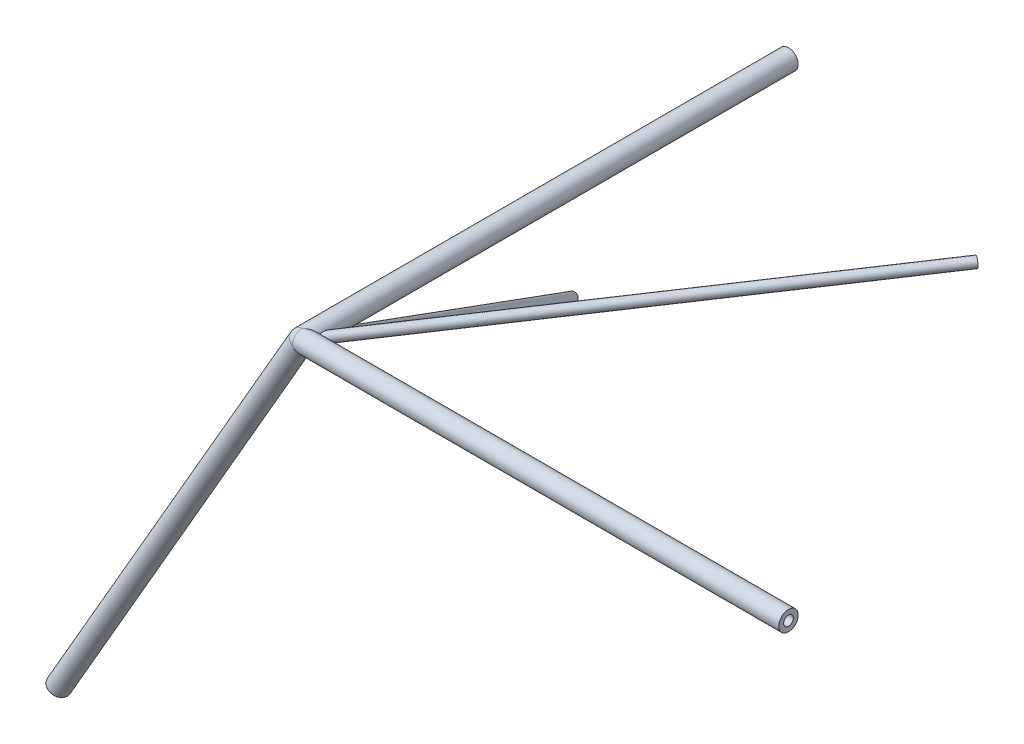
ISO-10303-21;
HEADER;
FILE_DESCRIPTION(('STEP AP214'),'2;1');
FILE_NAME('part.step','',(''),(''),'','','');
FILE_SCHEMA(('AUTOMOTIVE_DESIGN { 1 0 10303 214 1 1 1 1 }'));
ENDSEC;
DATA;
#1=APPLICATION_CONTEXT('core data for automotive mechanical design processes');
#2=APPLICATION_PROTOCOL_DEFINITION('international standard','automotive_design',2000,#1);
#3=PRODUCT_CONTEXT('',#1,'mechanical');
#4=PRODUCT('Part','Part','',(#3));
#5=PRODUCT_RELATED_PRODUCT_CATEGORY('part','',(#4));
#6=PRODUCT_DEFINITION_FORMATION('','',#4);
#7=PRODUCT_DEFINITION_CONTEXT('part definition',#1,'design');
#8=PRODUCT_DEFINITION('design','',#6,#7);
#9=PRODUCT_DEFINITION_SHAPE('','',#8);
#10=(LENGTH_UNIT() NAMED_UNIT(*) SI_UNIT(.MILLI.,.METRE.));
#11=(NAMED_UNIT(*) PLANE_ANGLE_UNIT() SI_UNIT($,.RADIAN.));
#12=(NAMED_UNIT(*) SI_UNIT($,.STERADIAN.) SOLID_ANGLE_UNIT());
#13=UNCERTAINTY_MEASURE_WITH_UNIT(LENGTH_MEASURE(1.E-05),#10,'distance_accuracy_value','');
#14=(GEOMETRIC_REPRESENTATION_CONTEXT(3) GLOBAL_UNCERTAINTY_ASSIGNED_CONTEXT((#13)) GLOBAL_UNIT_ASSIGNED_CONTEXT((#10,
#11,#12)) REPRESENTATION_CONTEXT('',''));
#15=CARTESIAN_POINT('',(0.,0.,0.));
#16=DIRECTION('',(0.,0.,1.));
#17=DIRECTION('',(1.,0.,0.));
#18=AXIS2_PLACEMENT_3D('',#15,#16,#17);
#19=CARTESIAN_POINT('',(0.,0.,0.));
#20=DIRECTION('',(1.,0.,0.));
#21=DIRECTION('',(0.,0.,-1.));
#22=AXIS2_PLACEMENT_3D('',#19,#20,#21);
#23=CYLINDRICAL_SURFACE('',#22,10.);
#24=CARTESIAN_POINT('',(0.657402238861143,0.,-10.));
#25=CARTESIAN_POINT('',(0.65740216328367,0.139606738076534,-10.0000001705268));
#26=CARTESIAN_POINT('',(0.662480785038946,0.279210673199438,-9.99707102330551));
#27=CARTESIAN_POINT('',(0.682793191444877,0.557485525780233,-9.98541979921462));
#28=CARTESIAN_POINT('',(0.698030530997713,0.69615609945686,-9.97669569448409));
#29=CARTESIAN_POINT('',(0.738637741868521,0.971470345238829,-9.95365859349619));
#30=CARTESIAN_POINT('',(0.76400298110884,1.10811491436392,-9.93934815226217));
#31=CARTESIAN_POINT('',(0.824846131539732,1.37851985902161,-9.90546596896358));
#32=CARTESIAN_POINT('',(0.860327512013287,1.51227922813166,-9.88589242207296));
#33=CARTESIAN_POINT('',(0.941369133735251,1.77596448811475,-9.84194205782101));
#34=CARTESIAN_POINT('',(0.986933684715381,1.90588871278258,-9.81756318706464));
#35=CARTESIAN_POINT('',(1.08805974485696,2.16089951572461,-9.76460302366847));
#36=CARTESIAN_POINT('',(1.14362107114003,2.28598618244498,-9.73602180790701));
#37=CARTESIAN_POINT('',(1.26464562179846,2.53042870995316,-9.67537040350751));
#38=CARTESIAN_POINT('',(1.33011096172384,2.6497833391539,-9.64329946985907));
#39=CARTESIAN_POINT('',(1.47074525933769,2.88179186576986,-9.5765256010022));
#40=CARTESIAN_POINT('',(1.54591038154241,2.99444838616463,-9.54182370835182));
#41=CARTESIAN_POINT('',(1.70473625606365,3.21090643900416,-9.47116062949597));
#42=CARTESIAN_POINT('',(1.7882805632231,3.31480018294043,-9.43522030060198));
#43=CARTESIAN_POINT('',(1.96425325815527,3.51444911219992,-9.36268793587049));
#44=CARTESIAN_POINT('',(2.0566779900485,3.61020761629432,-9.32609617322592));
#45=CARTESIAN_POINT('',(2.24995332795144,3.7929088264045,-9.2532974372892));
#46=CARTESIAN_POINT('',(2.35080147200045,3.87985409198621,-9.21709035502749));
#47=CARTESIAN_POINT('',(2.56033801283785,4.04436957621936,-9.14609780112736));
#48=CARTESIAN_POINT('',(2.66902608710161,4.12194018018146,-9.11131227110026));
#49=CARTESIAN_POINT('',(2.88880945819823,4.26424161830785,-9.04555875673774));
#50=CARTESIAN_POINT('',(2.99961673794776,4.32937222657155,-9.01449217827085));
#51=CARTESIAN_POINT('',(3.22697429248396,4.45040125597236,-8.95535972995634));
#52=CARTESIAN_POINT('',(3.34352647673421,4.50629658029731,-8.92729486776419));
#53=CARTESIAN_POINT('',(3.58140501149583,4.60873152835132,-8.87484721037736));
#54=CARTESIAN_POINT('',(3.70272919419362,4.65527534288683,-8.85046276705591));
#55=CARTESIAN_POINT('',(3.9492799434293,4.73914708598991,-8.80583433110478));
#56=CARTESIAN_POINT('',(4.07450795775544,4.7764715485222,-8.78559189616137));
#57=CARTESIAN_POINT('',(4.45611106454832,4.87530403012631,-8.73139570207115));
#58=CARTESIAN_POINT('',(4.71712617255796,4.92313188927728,-8.7042591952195));
#59=CARTESIAN_POINT('',(5.24422946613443,4.9855438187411,-8.66865494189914));
#60=CARTESIAN_POINT('',(5.51032128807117,5.00010308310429,-8.66020112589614));
#61=CARTESIAN_POINT('',(5.97776642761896,4.99992095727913,-8.66029467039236));
#62=CARTESIAN_POINT('',(6.17918004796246,4.99142565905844,-8.66521820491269));
#63=CARTESIAN_POINT('',(6.58044366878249,4.95912960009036,-8.68374286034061));
#64=CARTESIAN_POINT('',(6.78029290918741,4.93532181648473,-8.697347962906));
#65=CARTESIAN_POINT('',(7.17752979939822,4.87359871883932,-8.7320834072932));
#66=CARTESIAN_POINT('',(7.37491138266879,4.83565381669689,-8.75322952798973));
#67=CARTESIAN_POINT('',(7.76584457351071,4.74661204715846,-8.80183187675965));
#68=CARTESIAN_POINT('',(7.95939665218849,4.69551680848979,-8.82928732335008));
#69=CARTESIAN_POINT('',(8.34712913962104,4.57921896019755,-8.89017315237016));
#70=CARTESIAN_POINT('',(8.54118297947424,4.51366990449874,-8.92374594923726));
#71=CARTESIAN_POINT('',(8.92364969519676,4.36964166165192,-8.99514842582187));
#72=CARTESIAN_POINT('',(9.11206189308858,4.29116092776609,-9.03297861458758));
#73=CARTESIAN_POINT('',(9.4821243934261,4.12133861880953,-9.11171348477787));
#74=CARTESIAN_POINT('',(9.66378074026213,4.03000890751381,-9.15261531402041));
#75=CARTESIAN_POINT('',(10.019326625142,3.83413987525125,-9.23638041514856));
#76=CARTESIAN_POINT('',(10.1932181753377,3.7296040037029,-9.27924317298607));
#77=CARTESIAN_POINT('',(10.4905938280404,3.53380771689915,-9.35523291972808));
#78=CARTESIAN_POINT('',(10.6160581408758,3.44549484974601,-9.38819447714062));
#79=CARTESIAN_POINT('',(10.8607872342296,3.26062415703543,-9.45399137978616));
#80=CARTESIAN_POINT('',(10.9800506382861,3.16406451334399,-9.48682669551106));
#81=CARTESIAN_POINT('',(11.3266759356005,2.86163685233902,-9.58415119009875));
#82=CARTESIAN_POINT('',(11.543432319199,2.64266101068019,-9.64760478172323));
#83=CARTESIAN_POINT('',(11.8803908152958,2.23403063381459,-9.74885342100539));
#84=CARTESIAN_POINT('',(12.0106587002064,2.05324202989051,-9.78886777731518));
#85=CARTESIAN_POINT('',(12.2424153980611,1.67253711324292,-9.86103223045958));
#86=CARTESIAN_POINT('',(12.3439496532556,1.47265167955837,-9.89319473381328));
#87=CARTESIAN_POINT('',(12.4946254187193,1.09517949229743,-9.94131472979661));
#88=CARTESIAN_POINT('',(12.5499945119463,0.920343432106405,-9.95917227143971));
#89=CARTESIAN_POINT('',(12.632034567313,0.563371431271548,-9.98571655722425));
#90=CARTESIAN_POINT('',(12.6587292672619,0.381241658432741,-9.99441088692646));
#91=CARTESIAN_POINT('',(12.6810525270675,0.0142864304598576,-10.0016776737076));
#92=CARTESIAN_POINT('',(12.6765860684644,-0.170545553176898,-10.0002191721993));
#93=CARTESIAN_POINT('',(12.6367951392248,-0.536497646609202,-9.98727916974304));
#94=CARTESIAN_POINT('',(12.6014573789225,-0.717616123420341,-9.97579335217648));
#95=CARTESIAN_POINT('',(12.5048774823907,-1.06462554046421,-9.94463968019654));
#96=CARTESIAN_POINT('',(12.4446424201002,-1.230831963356,-9.92529035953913));
#97=CARTESIAN_POINT('',(12.302449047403,-1.55259098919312,-9.88007650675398));
#98=CARTESIAN_POINT('',(12.2204822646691,-1.70813940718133,-9.85420943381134));
#99=CARTESIAN_POINT('',(11.9836623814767,-2.09825796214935,-9.78045115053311));
#100=CARTESIAN_POINT('',(11.8147369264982,-2.3236104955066,-9.7287110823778));
#101=CARTESIAN_POINT('',(11.5372601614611,-2.63861971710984,-9.64621888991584));
#102=CARTESIAN_POINT('',(11.4405490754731,-2.73995443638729,-9.61785001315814));
#103=CARTESIAN_POINT('',(11.2402296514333,-2.9352484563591,-9.56005581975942));
#104=CARTESIAN_POINT('',(11.1366228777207,-3.02920941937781,-9.53063074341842));
#105=CARTESIAN_POINT('',(10.8695864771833,-3.25582189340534,-9.45622596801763));
#106=CARTESIAN_POINT('',(10.7024307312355,-3.38397191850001,-9.41091493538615));
#107=CARTESIAN_POINT('',(10.3574145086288,-3.62515507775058,-9.32066638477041));
#108=CARTESIAN_POINT('',(10.1795485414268,-3.73818036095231,-9.27572907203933));
#109=CARTESIAN_POINT('',(9.81475837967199,-3.94996415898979,-9.18754349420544));
#110=CARTESIAN_POINT('',(9.62782051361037,-4.04870018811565,-9.14429796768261));
#111=CARTESIAN_POINT('',(9.24657497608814,-4.23212086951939,-9.0608662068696));
#112=CARTESIAN_POINT('',(9.05226853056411,-4.3168078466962,-9.02067946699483));
#113=CARTESIAN_POINT('',(8.64996075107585,-4.47515561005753,-8.94321178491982));
#114=CARTESIAN_POINT('',(8.44171896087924,-4.54828672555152,-8.90609533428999));
#115=CARTESIAN_POINT('',(8.01944115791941,-4.67925337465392,-8.83798829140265));
#116=CARTESIAN_POINT('',(7.80540409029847,-4.73708610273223,-8.80699882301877));
#117=CARTESIAN_POINT('',(7.37308229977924,-4.83654244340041,-8.75277442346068));
#118=CARTESIAN_POINT('',(7.15480736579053,-4.87819960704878,-8.72952345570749));
#119=CARTESIAN_POINT('',(6.71488790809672,-4.94417795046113,-8.69232774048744));
#120=CARTESIAN_POINT('',(6.49324497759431,-4.96850708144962,-8.67837872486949));
#121=CARTESIAN_POINT('',(6.11608385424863,-4.99357021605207,-8.66397003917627));
#122=CARTESIAN_POINT('',(5.96099118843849,-4.99923437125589,-8.66069551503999));
#123=CARTESIAN_POINT('',(5.65075964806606,-5.00062063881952,-8.65989626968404));
#124=CARTESIAN_POINT('',(5.49562079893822,-4.99634555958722,-8.66236992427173));
#125=CARTESIAN_POINT('',(5.18631241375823,-4.97710192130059,-8.67344114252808));
#126=CARTESIAN_POINT('',(5.03214228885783,-4.96214065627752,-8.68203452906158));
#127=CARTESIAN_POINT('',(4.72580574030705,-4.92077558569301,-8.70554628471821));
#128=CARTESIAN_POINT('',(4.57363933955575,-4.89437164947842,-8.72046472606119));
#129=CARTESIAN_POINT('',(4.27115187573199,-4.82912707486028,-8.75676539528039));
#130=CARTESIAN_POINT('',(4.12086419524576,-4.79016541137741,-8.77821040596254));
#131=CARTESIAN_POINT('',(3.825217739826,-4.69937891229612,-8.8271452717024));
#132=CARTESIAN_POINT('',(3.67985897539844,-4.64755404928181,-8.85463513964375));
#133=CARTESIAN_POINT('',(3.39569987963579,-4.53083331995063,-8.91492324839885));
#134=CARTESIAN_POINT('',(3.25689670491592,-4.46594318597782,-8.94771915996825));
#135=CARTESIAN_POINT('',(2.98728147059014,-4.32316785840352,-9.01756756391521));
#136=CARTESIAN_POINT('',(2.85646837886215,-4.24528434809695,-9.05461950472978));
#137=CARTESIAN_POINT('',(2.62161961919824,-4.08861008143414,-9.12631473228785));
#138=CARTESIAN_POINT('',(2.5163840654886,-4.01143776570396,-9.16058129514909));
#139=CARTESIAN_POINT('',(2.31349269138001,-3.84819782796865,-9.23034386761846));
#140=CARTESIAN_POINT('',(2.21583664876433,-3.76213046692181,-9.26583984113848));
#141=CARTESIAN_POINT('',(2.02865697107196,-3.58166460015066,-9.33708127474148));
#142=CARTESIAN_POINT('',(1.93913345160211,-3.48726597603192,-9.37282673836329));
#143=CARTESIAN_POINT('',(1.76863117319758,-3.29079409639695,-9.4435996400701));
#144=CARTESIAN_POINT('',(1.68765262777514,-3.18872064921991,-9.47862706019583));
#145=CARTESIAN_POINT('',(1.53615593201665,-2.9798504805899,-9.54632328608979));
#146=CARTESIAN_POINT('',(1.46545364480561,-2.87319819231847,-9.57902619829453));
#147=CARTESIAN_POINT('',(1.33270008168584,-2.65391576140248,-9.64208228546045));
#148=CARTESIAN_POINT('',(1.27065250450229,-2.54128309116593,-9.67243445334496));
#149=CARTESIAN_POINT('',(1.15538448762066,-2.31084015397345,-9.73006280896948));
#150=CARTESIAN_POINT('',(1.10216375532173,-2.19303005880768,-9.75733909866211));
#151=CARTESIAN_POINT('',(1.00463979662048,-1.95300285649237,-9.8082023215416));
#152=CARTESIAN_POINT('',(0.96033701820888,-1.83078552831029,-9.83178906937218));
#153=CARTESIAN_POINT('',(0.876754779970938,-1.57039646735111,-9.87689217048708));
#154=CARTESIAN_POINT('',(0.838412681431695,-1.43184660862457,-9.89796952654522));
#155=CARTESIAN_POINT('',(0.772645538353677,-1.15144602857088,-9.93449373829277));
#156=CARTESIAN_POINT('',(0.745221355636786,-1.00959504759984,-9.94994014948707));
#157=CARTESIAN_POINT('',(0.701325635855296,-0.723669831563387,-9.97481312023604));
#158=CARTESIAN_POINT('',(0.684855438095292,-0.579595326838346,-9.98423894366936));
#159=CARTESIAN_POINT('',(0.662894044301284,-0.290346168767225,-9.99683214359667));
#160=CARTESIAN_POINT('',(0.657402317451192,-0.145171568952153,-9.99999982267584));
#161=CARTESIAN_POINT('',(0.657402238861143,0.,-10.));
#162=B_SPLINE_CURVE_WITH_KNOTS('',3,(#24,#25,#26,#27,#28,#29,#30,#31,#32,#33,#34,#35,#36,#37,
#38,#39,#40,#41,#42,#43,#44,#45,#46,#47,#48,#49,#50,#51,#52,#53,#54,#55,#56,#57,#58,#59,#60,#61,
#62,#63,#64,#65,#66,#67,#68,#69,#70,#71,#72,#73,#74,#75,#76,#77,#78,#79,#80,#81,#82,#83,#84,#85,
#86,#87,#88,#89,#90,#91,#92,#93,#94,#95,#96,#97,#98,#99,#100,#101,#102,#103,#104,#105,#106,#107,
#108,#109,#110,#111,#112,#113,#114,#115,#116,#117,#118,#119,#120,#121,#122,#123,#124,#125,#126,
#127,#128,#129,#130,#131,#132,#133,#134,#135,#136,#137,#138,#139,#140,#141,#142,#143,#144,#145,
#146,#147,#148,#149,#150,#151,#152,#153,#154,#155,#156,#157,#158,#159,#160,#161),.UNSPECIFIED.,
.T.,.F.,(4,2,2,2,2,2,2,2,2,2,2,2,2,2,2,2,2,2,2,2,2,2,2,2,2,2,2,2,2,2,2,2,2,2,2,2,2,2,2,2,2,2,2,
2,2,2,2,2,2,2,2,2,2,2,2,2,2,2,2,2,2,2,2,2,2,2,2,2,4),(0.,0.418692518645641,0.837531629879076,
1.25617940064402,1.67497091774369,2.09394178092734,2.51290498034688,2.931957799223,
3.35084542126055,3.76455736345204,4.17809971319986,4.59152161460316,5.00492651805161,
5.40114152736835,5.79748912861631,6.19365871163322,6.58997700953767,7.38681556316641,
8.18424806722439,8.78841580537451,9.39286083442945,9.99857810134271,10.604220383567,
11.2263643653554,11.8485828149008,12.4702304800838,13.0917161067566,13.5621683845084,
14.03272465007,14.971810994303,15.6488793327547,16.3248708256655,16.8753487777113,
17.4253706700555,17.9770704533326,18.5290078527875,19.0605190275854,19.5922377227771,
20.4460894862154,20.8746252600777,21.3030641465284,21.9484564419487,22.5941824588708,
23.2409137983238,23.8875380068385,24.5583025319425,25.2291899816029,25.8986783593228,
26.5678593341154,27.0331802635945,27.4983697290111,27.9632419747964,28.4281195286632,
28.8976184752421,29.3671184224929,29.8364128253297,30.3056464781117,30.7099161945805,
31.1141740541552,31.5184376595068,31.9227113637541,32.3184850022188,32.7144272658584,
33.1103564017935,33.5063054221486,33.9416208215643,34.3769705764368,34.8123735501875,
35.2477554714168),.UNSPECIFIED.);
#163=CARTESIAN_POINT('',(9.01388261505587,4.3301178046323,-9.01388261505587));
#164=VERTEX_POINT('',#163);
#165=CARTESIAN_POINT('',(9.01388261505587,-4.33011780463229,-9.01388261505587));
#166=VERTEX_POINT('',#165);
#167=EDGE_CURVE('E63',#164,#166,#162,.T.);
#168=ORIENTED_EDGE('',*,*,#167,.F.);
#169=CARTESIAN_POINT('',(0.,0.,0.));
#170=DIRECTION('',(0.707106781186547,0.,0.707106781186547));
#171=DIRECTION('',(0.707106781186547,0.,-0.707106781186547));
#172=AXIS2_PLACEMENT_3D('',#169,#170,#171);
#173=ELLIPSE('',#172,14.1421356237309,10.);
#174=CARTESIAN_POINT('',(0.,10.,0.));
#175=VERTEX_POINT('',#174);
#176=EDGE_CURVE('E246',#164,#175,#173,.T.);
#177=ORIENTED_EDGE('',*,*,#176,.T.);
#178=CARTESIAN_POINT('',(0.,0.,0.));
#179=DIRECTION('',(1.,0.,0.));
#180=DIRECTION('',(0.,0.,-1.));
#181=AXIS2_PLACEMENT_3D('',#178,#179,#180);
#182=CIRCLE('',#181,10.);
#183=CARTESIAN_POINT('',(0.,0.,10.));
#184=VERTEX_POINT('',#183);
#185=EDGE_CURVE('E239',#175,#184,#182,.T.);
#186=ORIENTED_EDGE('',*,*,#185,.T.);
#187=CARTESIAN_POINT('',(0.,0.,0.));
#188=DIRECTION('',(0.86602540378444,0.499999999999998,0.));
#189=DIRECTION('',(0.499999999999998,-0.86602540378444,0.));
#190=AXIS2_PLACEMENT_3D('',#187,#188,#189);
#191=ELLIPSE('',#190,11.5470053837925,10.);
#192=CARTESIAN_POINT('',(4.99999999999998,-8.66025403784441,-4.99999999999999));
#193=VERTEX_POINT('',#192);
#194=EDGE_CURVE('E228',#193,#184,#191,.F.);
#195=ORIENTED_EDGE('',*,*,#194,.F.);
#196=EDGE_CURVE('E247',#193,#166,#173,.T.);
#197=ORIENTED_EDGE('',*,*,#196,.T.);
#198=EDGE_LOOP('',(#168,#177,#186,#195,#197));
#199=FACE_BOUND('',#198,.T.);
#200=CARTESIAN_POINT('',(500.,0.,0.));
#201=DIRECTION('',(1.,0.,0.));
#202=DIRECTION('',(0.,0.,-1.));
#203=AXIS2_PLACEMENT_3D('',#200,#201,#202);
#204=CIRCLE('',#203,10.);
#205=CARTESIAN_POINT('',(500.,0.,-10.));
#206=VERTEX_POINT('',#205);
#207=EDGE_CURVE('E243',#206,#206,#204,.T.);
#208=ORIENTED_EDGE('',*,*,#207,.F.);
#209=EDGE_LOOP('',(#208));
#210=FACE_BOUND('',#209,.T.);
#211=ADVANCED_FACE('F38',(#199,#210),#23,.T.);
#212=CARTESIAN_POINT('',(500.,0.,0.));
#213=DIRECTION('',(1.,0.,0.));
#214=DIRECTION('',(0.,0.,-1.));
#215=AXIS2_PLACEMENT_3D('',#212,#213,#214);
#216=PLANE('',#215);
#217=CARTESIAN_POINT('',(500.,0.,0.));
#218=DIRECTION('',(1.,0.,0.));
#219=DIRECTION('',(0.,0.,-1.));
#220=AXIS2_PLACEMENT_3D('',#217,#218,#219);
#221=CIRCLE('',#220,5.);
#222=CARTESIAN_POINT('',(500.,0.,-5.));
#223=VERTEX_POINT('',#222);
#224=EDGE_CURVE('E123',#223,#223,#221,.T.);
#225=ORIENTED_EDGE('',*,*,#224,.F.);
#226=EDGE_LOOP('',(#225));
#227=FACE_BOUND('',#226,.T.);
#228=ORIENTED_EDGE('',*,*,#207,.T.);
#229=EDGE_LOOP('',(#228));
#230=FACE_BOUND('',#229,.T.);
#231=ADVANCED_FACE('F40',(#227,#230),#216,.T.);
#232=CARTESIAN_POINT('',(0.,0.,-500.));
#233=DIRECTION('',(0.,0.,1.));
#234=DIRECTION('',(1.,0.,0.));
#235=AXIS2_PLACEMENT_3D('',#232,#233,#234);
#236=PLANE('',#235);
#237=CARTESIAN_POINT('',(0.,0.,-500.));
#238=DIRECTION('',(0.,0.,1.));
#239=DIRECTION('',(1.,0.,0.));
#240=AXIS2_PLACEMENT_3D('',#237,#238,#239);
#241=CIRCLE('',#240,5.);
#242=CARTESIAN_POINT('',(5.,0.,-500.));
#243=VERTEX_POINT('',#242);
#244=EDGE_CURVE('E132',#243,#243,#241,.T.);
#245=ORIENTED_EDGE('',*,*,#244,.T.);
#246=EDGE_LOOP('',(#245));
#247=FACE_BOUND('',#246,.T.);
#248=CARTESIAN_POINT('',(0.,0.,-500.));
#249=DIRECTION('',(0.,0.,1.));
#250=DIRECTION('',(1.,0.,0.));
#251=AXIS2_PLACEMENT_3D('',#248,#249,#250);
#252=CIRCLE('',#251,10.);
#253=CARTESIAN_POINT('',(10.,0.,-500.));
#254=VERTEX_POINT('',#253);
#255=EDGE_CURVE('E236',#254,#254,#252,.T.);
#256=ORIENTED_EDGE('',*,*,#255,.F.);
#257=EDGE_LOOP('',(#256));
#258=FACE_BOUND('',#257,.T.);
#259=ADVANCED_FACE('F204',(#247,#258),#236,.F.);
#260=CARTESIAN_POINT('',(0.,0.,0.));
#261=DIRECTION('',(0.,0.,-1.));
#262=DIRECTION('',(-1.,0.,0.));
#263=AXIS2_PLACEMENT_3D('',#260,#261,#262);
#264=CYLINDRICAL_SURFACE('',#263,10.);
#265=CARTESIAN_POINT('',(0.,0.,0.));
#266=DIRECTION('',(0.353553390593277,0.612372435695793,-0.707106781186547));
#267=DIRECTION('',(-0.353553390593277,-0.612372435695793,-0.707106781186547));
#268=AXIS2_PLACEMENT_3D('',#265,#266,#267);
#269=ELLIPSE('',#268,14.142135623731,10.);
#270=CARTESIAN_POINT('',(-0.756949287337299,-9.97131023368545,-9.01388261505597));
#271=VERTEX_POINT('',#270);
#272=EDGE_CURVE('E250',#193,#271,#269,.T.);
#273=ORIENTED_EDGE('',*,*,#272,.T.);
#274=CARTESIAN_POINT('',(-6.75640709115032,-7.3723105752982,-22.7692682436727));
#275=CARTESIAN_POINT('',(-6.85741256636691,-7.27974724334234,-22.6089535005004));
#276=CARTESIAN_POINT('',(-6.95044421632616,-7.19070572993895,-22.4416148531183));
#277=CARTESIAN_POINT('',(-7.12384734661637,-7.01895003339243,-22.0973123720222));
#278=CARTESIAN_POINT('',(-7.20420458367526,-6.9362430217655,-21.9203380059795));
#279=CARTESIAN_POINT('',(-7.35495024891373,-6.77619697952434,-21.5585662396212));
#280=CARTESIAN_POINT('',(-7.42528184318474,-6.69888972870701,-21.3737313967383));
#281=CARTESIAN_POINT('',(-7.55720117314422,-6.54970275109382,-20.9989596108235));
#282=CARTESIAN_POINT('',(-7.61879217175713,-6.47782100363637,-20.809024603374));
#283=CARTESIAN_POINT('',(-7.74277281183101,-6.32930534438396,-20.3979814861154));
#284=CARTESIAN_POINT('',(-7.80404455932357,-6.25343609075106,-20.1762622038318));
#285=CARTESIAN_POINT('',(-7.918426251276,-6.10795184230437,-19.7286738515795));
#286=CARTESIAN_POINT('',(-7.97153435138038,-6.03833826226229,-19.5028038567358));
#287=CARTESIAN_POINT('',(-8.07068407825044,-5.90516322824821,-19.0474898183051));
#288=CARTESIAN_POINT('',(-8.11671805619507,-5.84160835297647,-18.8180421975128));
#289=CARTESIAN_POINT('',(-8.20242884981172,-5.72063382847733,-18.3563872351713));
#290=CARTESIAN_POINT('',(-8.24210617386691,-5.66321368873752,-18.1241801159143));
#291=CARTESIAN_POINT('',(-8.31566182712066,-5.55464345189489,-17.6574798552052));
#292=CARTESIAN_POINT('',(-8.3495420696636,-5.5034912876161,-17.4229874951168));
#293=CARTESIAN_POINT('',(-8.41191182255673,-5.4076802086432,-16.9519592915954));
#294=CARTESIAN_POINT('',(-8.44040112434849,-5.36302154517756,-16.7154233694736));
#295=CARTESIAN_POINT('',(-8.49220761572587,-5.28060383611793,-16.240772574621));
#296=CARTESIAN_POINT('',(-8.51552870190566,-5.24283959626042,-16.0026590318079));
#297=CARTESIAN_POINT('',(-8.55711849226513,-5.17468015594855,-15.5249597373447));
#298=CARTESIAN_POINT('',(-8.57538760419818,-5.14428436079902,-15.285374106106));
#299=CARTESIAN_POINT('',(-8.61077808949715,-5.08487850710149,-14.7446681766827));
#300=CARTESIAN_POINT('',(-8.62646020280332,-5.05813156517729,-14.4431979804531));
#301=CARTESIAN_POINT('',(-8.64939856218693,-5.01880764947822,-13.8389480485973));
#302=CARTESIAN_POINT('',(-8.65665381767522,-5.00623234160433,-13.5361681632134));
#303=CARTESIAN_POINT('',(-8.66178123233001,-4.99735738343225,-12.9308000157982));
#304=CARTESIAN_POINT('',(-8.65967054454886,-5.00102797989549,-12.6282124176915));
#305=CARTESIAN_POINT('',(-8.64454250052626,-5.0271428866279,-12.0241226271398));
#306=CARTESIAN_POINT('',(-8.63152945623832,-5.04957977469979,-11.7226200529));
#307=CARTESIAN_POINT('',(-8.59854068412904,-5.10546219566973,-11.2196295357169));
#308=CARTESIAN_POINT('',(-8.58216459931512,-5.13302263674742,-11.0172495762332));
#309=CARTESIAN_POINT('',(-8.54228549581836,-5.19912181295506,-10.6150157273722));
#310=CARTESIAN_POINT('',(-8.51878457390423,-5.23765731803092,-10.4151611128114));
#311=CARTESIAN_POINT('',(-8.46344458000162,-5.32661705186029,-10.0194909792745));
#312=CARTESIAN_POINT('',(-8.4316149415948,-5.37702782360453,-9.82367115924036));
#313=CARTESIAN_POINT('',(-8.35813039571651,-5.49055937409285,-9.43762729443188));
#314=CARTESIAN_POINT('',(-8.31647872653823,-5.55367596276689,-9.24740142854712));
#315=CARTESIAN_POINT('',(-8.2339469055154,-5.67503291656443,-8.92294492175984));
#316=CARTESIAN_POINT('',(-8.19564952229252,-5.73031759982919,-8.78694868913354));
#317=CARTESIAN_POINT('',(-8.11201620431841,-5.84811228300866,-8.52028463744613));
#318=CARTESIAN_POINT('',(-8.06667876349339,-5.91062382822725,-8.38961796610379));
#319=CARTESIAN_POINT('',(-7.96829604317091,-6.04260096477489,-8.13487978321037));
#320=CARTESIAN_POINT('',(-7.91525252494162,-6.1120649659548,-8.01080677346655));
#321=CARTESIAN_POINT('',(-7.80086295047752,-6.25740205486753,-7.77055925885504));
#322=CARTESIAN_POINT('',(-7.73952112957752,-6.33327186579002,-7.65438076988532));
#323=CARTESIAN_POINT('',(-7.60737583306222,-6.49142128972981,-7.43003202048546));
#324=CARTESIAN_POINT('',(-7.53648412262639,-6.57375726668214,-7.32195314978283));
#325=CARTESIAN_POINT('',(-7.38541508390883,-6.74303379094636,-7.11637437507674));
#326=CARTESIAN_POINT('',(-7.30523747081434,-6.82997447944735,-7.01887479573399));
#327=CARTESIAN_POINT('',(-7.13557490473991,-7.00703885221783,-6.83564522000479));
#328=CARTESIAN_POINT('',(-7.04609349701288,-7.09716131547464,-6.74991076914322));
#329=CARTESIAN_POINT('',(-6.85801351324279,-7.27906239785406,-6.59114909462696));
#330=CARTESIAN_POINT('',(-6.75941646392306,-7.37084073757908,-6.51811974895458));
#331=CARTESIAN_POINT('',(-6.56874699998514,-7.54091526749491,-6.39528877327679));
#332=CARTESIAN_POINT('',(-6.47784912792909,-7.61920824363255,-6.34365052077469));
#333=CARTESIAN_POINT('',(-6.29021941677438,-7.77483039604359,-6.25052173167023));
#334=CARTESIAN_POINT('',(-6.1934880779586,-7.85215965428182,-6.20903032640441));
#335=CARTESIAN_POINT('',(-5.99478395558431,-8.00489003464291,-6.1364688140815));
#336=CARTESIAN_POINT('',(-5.89281256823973,-8.08029166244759,-6.10539594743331));
#337=CARTESIAN_POINT('',(-5.68428229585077,-8.22832184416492,-6.05383671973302));
#338=CARTESIAN_POINT('',(-5.57772352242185,-8.30095046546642,-6.03335010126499));
#339=CARTESIAN_POINT('',(-5.36793540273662,-8.43800477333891,-6.00406872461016));
#340=CARTESIAN_POINT('',(-5.26494745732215,-8.50265586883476,-5.9945940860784));
#341=CARTESIAN_POINT('',(-5.0563195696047,-8.62835247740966,-5.98502080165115));
#342=CARTESIAN_POINT('',(-4.95067877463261,-8.68939680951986,-5.98492520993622));
#343=CARTESIAN_POINT('',(-4.73760600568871,-8.8073782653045,-5.99411614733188));
#344=CARTESIAN_POINT('',(-4.63017505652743,-8.86431764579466,-6.00339747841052));
#345=CARTESIAN_POINT('',(-4.41424122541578,-8.97380260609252,-6.03129780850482));
#346=CARTESIAN_POINT('',(-4.30573796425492,-9.02634656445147,-6.04992023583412));
#347=CARTESIAN_POINT('',(-4.08965458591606,-9.12626716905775,-6.09618196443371));
#348=CARTESIAN_POINT('',(-3.98207619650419,-9.17369059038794,-6.1237284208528));
#349=CARTESIAN_POINT('',(-3.76757122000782,-9.26385167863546,-6.1877626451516));
#350=CARTESIAN_POINT('',(-3.66064488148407,-9.30658765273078,-6.22425362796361));
#351=CARTESIAN_POINT('',(-3.44840492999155,-9.38729933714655,-6.30595726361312));
#352=CARTESIAN_POINT('',(-3.34309059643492,-9.42527723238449,-6.35116588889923));
#353=CARTESIAN_POINT('',(-3.13484817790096,-9.4965701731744,-6.45006960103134));
#354=CARTESIAN_POINT('',(-3.03192098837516,-9.52988349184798,-6.50376781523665));
#355=CARTESIAN_POINT('',(-2.8280725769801,-9.59236734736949,-6.6200124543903));
#356=CARTESIAN_POINT('',(-2.72719172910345,-9.62148174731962,-6.68265980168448));
#357=CARTESIAN_POINT('',(-2.52953091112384,-9.67532801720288,-6.81587839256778));
#358=CARTESIAN_POINT('',(-2.43275243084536,-9.70005830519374,-6.88645248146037));
#359=CARTESIAN_POINT('',(-2.24407230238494,-9.74543758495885,-7.0349717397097));
#360=CARTESIAN_POINT('',(-2.15216895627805,-9.76608800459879,-7.11291431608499));
#361=CARTESIAN_POINT('',(-1.97377254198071,-9.80370010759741,-7.27560705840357));
#362=CARTESIAN_POINT('',(-1.88728147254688,-9.82066043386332,-7.3603597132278));
#363=CARTESIAN_POINT('',(-1.62675162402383,-9.86843864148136,-7.63434358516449));
#364=CARTESIAN_POINT('',(-1.46292165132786,-9.89355472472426,-7.83446361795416));
#365=CARTESIAN_POINT('',(-1.16415960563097,-9.93315564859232,-8.25598424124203));
#366=CARTESIAN_POINT('',(-1.02924447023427,-9.94763427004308,-8.4773971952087));
#367=CARTESIAN_POINT('',(-0.814255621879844,-9.96724073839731,-8.88530811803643));
#368=CARTESIAN_POINT('',(-0.728639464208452,-9.97371993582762,-9.06887552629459));
#369=CARTESIAN_POINT('',(-0.573785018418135,-9.98382727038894,-9.44293171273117));
#370=CARTESIAN_POINT('',(-0.50455483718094,-9.9874539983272,-9.63342386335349));
#371=CARTESIAN_POINT('',(-0.381152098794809,-9.99292445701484,-10.0195346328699));
#372=CARTESIAN_POINT('',(-0.327004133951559,-9.99476528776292,-10.2151610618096));
#373=CARTESIAN_POINT('',(-0.232477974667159,-9.99740767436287,-10.6097464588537));
#374=CARTESIAN_POINT('',(-0.192105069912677,-9.99820883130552,-10.8087066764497));
#375=CARTESIAN_POINT('',(-0.0999990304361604,-9.99967496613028,-11.3476346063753));
#376=CARTESIAN_POINT('',(-0.0598401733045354,-9.99985920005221,-11.6895950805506));
#377=CARTESIAN_POINT('',(-0.00902957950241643,-10.0000222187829,-12.3757352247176));
#378=CARTESIAN_POINT('',(0.00159875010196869,-10.0000008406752,-12.7199164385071));
#379=CARTESIAN_POINT('',(-0.00199038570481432,-9.99999915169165,-13.4096906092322));
#380=CARTESIAN_POINT('',(-0.0163249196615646,-10.0000190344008,-13.755282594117));
#381=CARTESIAN_POINT('',(-0.0665455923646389,-9.99980927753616,-14.444727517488));
#382=CARTESIAN_POINT('',(-0.102424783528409,-9.99957971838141,-14.7885809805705));
#383=CARTESIAN_POINT('',(-0.183757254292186,-9.99837516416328,-15.4016534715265));
#384=CARTESIAN_POINT('',(-0.225610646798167,-9.99756707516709,-15.6713617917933));
#385=CARTESIAN_POINT('',(-0.32047893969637,-9.9949761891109,-16.2088330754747));
#386=CARTESIAN_POINT('',(-0.37349504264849,-9.99319328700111,-16.4765958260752));
#387=CARTESIAN_POINT('',(-0.49028633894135,-9.98814504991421,-17.010126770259));
#388=CARTESIAN_POINT('',(-0.554076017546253,-9.98487770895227,-17.2758917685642));
#389=CARTESIAN_POINT('',(-0.692184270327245,-9.9762554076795,-17.8046215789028));
#390=CARTESIAN_POINT('',(-0.766502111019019,-9.97090059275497,-18.0675865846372));
#391=CARTESIAN_POINT('',(-0.92546435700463,-9.95740213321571,-18.5891086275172));
#392=CARTESIAN_POINT('',(-1.01006422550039,-9.94927025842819,-18.8476795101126));
#393=CARTESIAN_POINT('',(-1.19031074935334,-9.92931998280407,-19.3608733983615));
#394=CARTESIAN_POINT('',(-1.28595948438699,-9.91750088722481,-19.6154956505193));
#395=CARTESIAN_POINT('',(-1.48893586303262,-9.88906256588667,-20.1191782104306));
#396=CARTESIAN_POINT('',(-1.59623890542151,-9.87245333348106,-20.3682489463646));
#397=CARTESIAN_POINT('',(-1.82400011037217,-9.83292575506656,-20.8597264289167));
#398=CARTESIAN_POINT('',(-1.94445139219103,-9.81001069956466,-21.1021365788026));
#399=CARTESIAN_POINT('',(-2.15120355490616,-9.76620465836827,-21.4860367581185));
#400=CARTESIAN_POINT('',(-2.23275495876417,-9.7479425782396,-21.6303861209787));
#401=CARTESIAN_POINT('',(-2.40232882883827,-9.70754503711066,-21.9147630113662));
#402=CARTESIAN_POINT('',(-2.49035301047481,-9.68540854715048,-22.0547893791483));
#403=CARTESIAN_POINT('',(-2.67339073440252,-9.63648966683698,-22.328740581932));
#404=CARTESIAN_POINT('',(-2.76838106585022,-9.60972233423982,-22.4626834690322));
#405=CARTESIAN_POINT('',(-2.96655680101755,-9.55040521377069,-22.722948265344));
#406=CARTESIAN_POINT('',(-3.06973616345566,-9.51785966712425,-22.8492756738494));
#407=CARTESIAN_POINT('',(-3.28479127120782,-9.44578928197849,-23.0906893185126));
#408=CARTESIAN_POINT('',(-3.39660296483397,-9.40631351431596,-23.2058462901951));
#409=CARTESIAN_POINT('',(-3.63070656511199,-9.31845406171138,-23.4215029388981));
#410=CARTESIAN_POINT('',(-3.75299606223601,-9.27007242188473,-23.5220059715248));
#411=CARTESIAN_POINT('',(-3.98509143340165,-9.17234200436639,-23.6851608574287));
#412=CARTESIAN_POINT('',(-4.0931059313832,-9.12477918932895,-23.7513730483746));
#413=CARTESIAN_POINT('',(-4.31539370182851,-9.02176688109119,-23.864329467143));
#414=CARTESIAN_POINT('',(-4.42965391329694,-8.96633348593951,-23.9111126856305));
#415=CARTESIAN_POINT('',(-4.64100401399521,-8.85847241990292,-23.9739097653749));
#416=CARTESIAN_POINT('',(-4.73751807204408,-8.80727456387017,-23.9939254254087));
#417=CARTESIAN_POINT('',(-4.93034897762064,-8.7007906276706,-24.0153656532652));
#418=CARTESIAN_POINT('',(-5.02666591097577,-8.6455071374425,-24.0168018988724));
#419=CARTESIAN_POINT('',(-5.21612494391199,-8.53253802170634,-24.0009473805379));
#420=CARTESIAN_POINT('',(-5.30927017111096,-8.47485489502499,-23.9836756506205));
#421=CARTESIAN_POINT('',(-5.49026890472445,-8.35874115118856,-23.9322028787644));
#422=CARTESIAN_POINT('',(-5.57811659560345,-8.30030979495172,-23.8979835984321));
#423=CARTESIAN_POINT('',(-5.7829055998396,-8.15961261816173,-23.7980068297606));
#424=CARTESIAN_POINT('',(-5.89651815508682,-8.07767285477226,-23.7250363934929));
#425=CARTESIAN_POINT('',(-6.11031149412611,-7.91720264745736,-23.5586543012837));
#426=CARTESIAN_POINT('',(-6.21046007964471,-7.83868066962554,-23.465195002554));
#427=CARTESIAN_POINT('',(-6.38871560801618,-7.69389616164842,-23.2747508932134));
#428=CARTESIAN_POINT('',(-6.468033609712,-7.62721594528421,-23.1791874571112));
#429=CARTESIAN_POINT('',(-6.6182090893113,-7.49727585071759,-22.9798703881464));
#430=CARTESIAN_POINT('',(-6.68907955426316,-7.43401080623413,-22.8761297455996));
#431=CARTESIAN_POINT('',(-6.75640709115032,-7.3723105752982,-22.7692682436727));
#432=B_SPLINE_CURVE_WITH_KNOTS('',3,(#274,#275,#276,#277,#278,#279,#280,#281,#282,#283,#284,
#285,#286,#287,#288,#289,#290,#291,#292,#293,#294,#295,#296,#297,#298,#299,#300,#301,#302,#303,
#304,#305,#306,#307,#308,#309,#310,#311,#312,#313,#314,#315,#316,#317,#318,#319,#320,#321,#322,
#323,#324,#325,#326,#327,#328,#329,#330,#331,#332,#333,#334,#335,#336,#337,#338,#339,#340,#341,
#342,#343,#344,#345,#346,#347,#348,#349,#350,#351,#352,#353,#354,#355,#356,#357,#358,#359,#360,
#361,#362,#363,#364,#365,#366,#367,#368,#369,#370,#371,#372,#373,#374,#375,#376,#377,#378,#379,
#380,#381,#382,#383,#384,#385,#386,#387,#388,#389,#390,#391,#392,#393,#394,#395,#396,#397,#398,
#399,#400,#401,#402,#403,#404,#405,#406,#407,#408,#409,#410,#411,#412,#413,#414,#415,#416,#417,
#418,#419,#420,#421,#422,#423,#424,#425,#426,#427,#428,#429,#430,#431),.UNSPECIFIED.,.T.,.F.,(4,
2,2,2,2,2,2,2,2,2,2,2,2,2,2,2,2,2,2,2,2,2,2,2,2,2,2,2,2,2,2,2,2,2,2,2,2,2,2,2,2,2,2,2,2,2,2,2,2,
2,2,2,2,2,2,2,2,2,2,2,2,2,2,2,2,2,2,2,2,2,2,2,2,2,2,2,2,2,4),(0.,0.632469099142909,
1.26564396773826,1.9022764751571,2.53867069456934,3.26502708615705,3.99154733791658,
4.71884768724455,5.44608984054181,6.17309150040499,6.90012127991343,7.62660103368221,
8.35302213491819,9.26178938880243,10.1706634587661,11.0778736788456,11.9847252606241,
12.5990735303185,13.2132411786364,13.826716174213,14.43998919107,14.8947622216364,
15.3496326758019,15.804399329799,16.2589347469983,16.7180018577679,17.1770830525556,
17.6359899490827,18.0948201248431,18.4861393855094,18.8774251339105,19.2686071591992,
19.6597796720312,20.0252453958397,20.3908301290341,20.7562123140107,21.1217286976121,
21.483558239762,21.8455180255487,22.2073109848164,22.5692375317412,22.9356260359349,
23.3021464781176,23.668538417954,24.035064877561,24.8112982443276,25.5879850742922,
26.1951074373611,26.8025295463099,27.4109363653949,28.0195765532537,29.0507932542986,
30.0828271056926,31.1197139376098,32.1562665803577,32.9748464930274,33.7935146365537,
34.6132923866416,35.4330130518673,36.2493018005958,37.0657444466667,37.8804959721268,
38.6948231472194,39.1950308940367,39.6953716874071,40.1941151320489,40.6924939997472,
41.1874767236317,41.6823459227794,42.0869533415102,42.4907448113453,42.8224570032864,
43.1539606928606,43.4851274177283,43.8166513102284,44.2877981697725,44.7600524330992,
45.1822971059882,45.603884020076),.UNSPECIFIED.);
#433=CARTESIAN_POINT('',(-8.25693332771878,-5.64119242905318,-9.01388261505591));
#434=VERTEX_POINT('',#433);
#435=EDGE_CURVE('E154',#271,#434,#432,.T.);
#436=ORIENTED_EDGE('',*,*,#435,.T.);
#437=CARTESIAN_POINT('',(-8.66025403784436,5.00000000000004,0.));
#438=VERTEX_POINT('',#437);
#439=EDGE_CURVE('E249',#434,#438,#269,.T.);
#440=ORIENTED_EDGE('',*,*,#439,.T.);
#441=CARTESIAN_POINT('',(0.,0.,0.));
#442=DIRECTION('',(0.,0.,1.));
#443=DIRECTION('',(1.,0.,0.));
#444=AXIS2_PLACEMENT_3D('',#441,#442,#443);
#445=CIRCLE('',#444,10.);
#446=EDGE_CURVE('E230',#175,#438,#445,.T.);
#447=ORIENTED_EDGE('',*,*,#446,.F.);
#448=ORIENTED_EDGE('',*,*,#176,.F.);
#449=CARTESIAN_POINT('',(10.,0.,-24.0139324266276));
#450=CARTESIAN_POINT('',(9.99999652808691,-0.120732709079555,-24.0139155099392));
#451=CARTESIAN_POINT('',(9.9977845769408,-0.241530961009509,-24.0026295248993));
#452=CARTESIAN_POINT('',(9.98922884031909,-0.479090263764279,-23.9588858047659));
#453=CARTESIAN_POINT('',(9.98287891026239,-0.595845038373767,-23.9263965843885));
#454=CARTESIAN_POINT('',(9.96471008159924,-0.851406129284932,-23.8331310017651));
#455=CARTESIAN_POINT('',(9.95190997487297,-0.988251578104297,-23.7672565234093));
#456=CARTESIAN_POINT('',(9.9225019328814,-1.24954909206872,-23.6150350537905));
#457=CARTESIAN_POINT('',(9.90588547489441,-1.37397251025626,-23.5286422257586));
#458=CARTESIAN_POINT('',(9.87278648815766,-1.59325816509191,-23.3553550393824));
#459=CARTESIAN_POINT('',(9.85664926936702,-1.68976831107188,-23.2704336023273));
#460=CARTESIAN_POINT('',(9.82309240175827,-1.8750273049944,-23.0926731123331));
#461=CARTESIAN_POINT('',(9.8056717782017,-1.96377013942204,-22.9998280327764));
#462=CARTESIAN_POINT('',(9.76994506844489,-2.13442764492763,-22.8080169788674));
#463=CARTESIAN_POINT('',(9.75163765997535,-2.21633159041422,-22.7090417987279));
#464=CARTESIAN_POINT('',(9.71445494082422,-2.37401032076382,-22.5063940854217));
#465=CARTESIAN_POINT('',(9.69557940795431,-2.44978266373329,-22.4027197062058));
#466=CARTESIAN_POINT('',(9.65582718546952,-2.60225721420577,-22.1824506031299));
#467=CARTESIAN_POINT('',(9.63491977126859,-2.67846197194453,-22.0655185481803));
#468=CARTESIAN_POINT('',(9.59292147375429,-2.8251841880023,-21.8281576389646));
#469=CARTESIAN_POINT('',(9.57183054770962,-2.895700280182,-21.7077279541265));
#470=CARTESIAN_POINT('',(9.50851208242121,-3.09977328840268,-21.3420209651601));
#471=CARTESIAN_POINT('',(9.4662699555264,-3.22573970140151,-21.0924971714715));
#472=CARTESIAN_POINT('',(9.38261213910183,-3.46153503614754,-20.5846959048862));
#473=CARTESIAN_POINT('',(9.34120047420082,-3.57129675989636,-20.3263871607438));
#474=CARTESIAN_POINT('',(9.26013776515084,-3.77650670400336,-19.804032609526));
#475=CARTESIAN_POINT('',(9.22048599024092,-3.87196090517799,-19.5399892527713));
#476=CARTESIAN_POINT('',(9.14463476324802,-4.04778327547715,-19.0147078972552));
#477=CARTESIAN_POINT('',(9.10837025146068,-4.12849495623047,-18.7535934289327));
#478=CARTESIAN_POINT('',(9.03866040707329,-4.27895877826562,-18.2278203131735));
#479=CARTESIAN_POINT('',(9.00521549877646,-4.34870927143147,-17.9631611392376));
#480=CARTESIAN_POINT('',(8.94169045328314,-4.47787368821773,-17.430601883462));
#481=CARTESIAN_POINT('',(8.91161433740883,-4.53727530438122,-17.1626983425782));
#482=CARTESIAN_POINT('',(8.8554938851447,-4.64585408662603,-16.6244259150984));
#483=CARTESIAN_POINT('',(8.82944927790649,-4.69503193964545,-16.3540571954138));
#484=CARTESIAN_POINT('',(8.78217426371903,-4.78287480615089,-15.8123837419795));
#485=CARTESIAN_POINT('',(8.76092382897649,-4.82158369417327,-15.5410878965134));
#486=CARTESIAN_POINT('',(8.72385197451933,-4.88833984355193,-14.9967769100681));
#487=CARTESIAN_POINT('',(8.70803111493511,-4.9163860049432,-14.7237615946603));
#488=CARTESIAN_POINT('',(8.68269421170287,-4.96099586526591,-14.1768809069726));
#489=CARTESIAN_POINT('',(8.6731691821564,-4.9775759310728,-13.9030173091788));
#490=CARTESIAN_POINT('',(8.66134283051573,-4.9981292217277,-13.3547041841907));
#491=CARTESIAN_POINT('',(8.65903927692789,-5.00210634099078,-13.0802548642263));
#492=CARTESIAN_POINT('',(8.6622227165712,-4.99658816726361,-12.6018316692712));
#493=CARTESIAN_POINT('',(8.66586573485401,-4.99028213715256,-12.3978083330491));
#494=CARTESIAN_POINT('',(8.67816615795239,-4.96886229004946,-11.990363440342));
#495=CARTESIAN_POINT('',(8.68682332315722,-4.95374889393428,-11.7869418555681));
#496=CARTESIAN_POINT('',(8.70959026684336,-4.91361114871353,-11.381237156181));
#497=CARTESIAN_POINT('',(8.72370333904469,-4.8885808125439,-11.1789548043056));
#498=CARTESIAN_POINT('',(8.75776031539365,-4.82730455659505,-10.7765557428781));
#499=CARTESIAN_POINT('',(8.77770430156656,-4.79105847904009,-10.5764390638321));
#500=CARTESIAN_POINT('',(8.82399196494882,-4.70527182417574,-10.1769087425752));
#501=CARTESIAN_POINT('',(8.85041866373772,-4.65555782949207,-9.97754133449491));
#502=CARTESIAN_POINT('',(8.90956825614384,-4.54133646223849,-9.58395727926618));
#503=CARTESIAN_POINT('',(8.94229190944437,-4.47682730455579,-9.38974125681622));
#504=CARTESIAN_POINT('',(9.01360239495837,-4.33145628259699,-9.00916962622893));
#505=CARTESIAN_POINT('',(9.05217393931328,-4.25063688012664,-8.82279509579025));
#506=CARTESIAN_POINT('',(9.13437278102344,-4.07099267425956,-8.46012416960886));
#507=CARTESIAN_POINT('',(9.17799691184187,-3.97217912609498,-8.28382156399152));
#508=CARTESIAN_POINT('',(9.25320206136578,-3.79264876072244,-8.00255628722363));
#509=CARTESIAN_POINT('',(9.28378608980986,-3.71733741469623,-7.89385320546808));
#510=CARTESIAN_POINT('',(9.34587444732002,-3.55835830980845,-7.68303500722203));
#511=CARTESIAN_POINT('',(9.37737851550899,-3.47469290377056,-7.58091804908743));
#512=CARTESIAN_POINT('',(9.4406103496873,-3.2990280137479,-7.38416489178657));
#513=CARTESIAN_POINT('',(9.47233813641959,-3.20702774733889,-7.28952939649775));
#514=CARTESIAN_POINT('',(9.53520172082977,-3.01498387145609,-7.1086656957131));
#515=CARTESIAN_POINT('',(9.56633777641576,-2.9149438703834,-7.02243375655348));
#516=CARTESIAN_POINT('',(9.62734761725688,-2.70666099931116,-6.85867915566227));
#517=CARTESIAN_POINT('',(9.65721352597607,-2.598376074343,-6.78120695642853));
#518=CARTESIAN_POINT('',(9.71462425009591,-2.37474177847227,-6.63622154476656));
#519=CARTESIAN_POINT('',(9.74216902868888,-2.25939229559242,-6.56870849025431));
#520=CARTESIAN_POINT('',(9.79409923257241,-2.02245571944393,-6.44421522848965));
#521=CARTESIAN_POINT('',(9.81848454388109,-1.90086840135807,-6.38723540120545));
#522=CARTESIAN_POINT('',(9.86333532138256,-1.65243524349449,-6.28426087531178));
#523=CARTESIAN_POINT('',(9.88380107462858,-1.52558978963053,-6.23826537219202));
#524=CARTESIAN_POINT('',(9.91864238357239,-1.27857713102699,-6.16097982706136));
#525=CARTESIAN_POINT('',(9.93338546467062,-1.15874593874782,-6.12877813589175));
#526=CARTESIAN_POINT('',(9.9586658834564,-0.916415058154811,-6.07402288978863));
#527=CARTESIAN_POINT('',(9.96920174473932,-0.793914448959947,-6.05147272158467));
#528=CARTESIAN_POINT('',(9.98577721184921,-0.547284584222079,-6.01616296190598));
#529=CARTESIAN_POINT('',(9.9918194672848,-0.423156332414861,-6.00339760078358));
#530=CARTESIAN_POINT('',(9.99926084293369,-0.174094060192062,-5.98769319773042));
#531=CARTESIAN_POINT('',(10.0006582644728,-0.0491597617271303,-5.98475775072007));
#532=CARTESIAN_POINT('',(9.99879865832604,0.19659774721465,-5.98867416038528));
#533=CARTESIAN_POINT('',(9.99568619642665,0.317427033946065,-5.99522202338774));
#534=CARTESIAN_POINT('',(9.98514153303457,0.558086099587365,-6.01753436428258));
#535=CARTESIAN_POINT('',(9.97770778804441,0.677915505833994,-6.03330213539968));
#536=CARTESIAN_POINT('',(9.95870741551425,0.915617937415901,-6.07397485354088));
#537=CARTESIAN_POINT('',(9.94714285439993,1.03349191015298,-6.09887523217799));
#538=CARTESIAN_POINT('',(9.92016095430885,1.26656012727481,-6.15770416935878));
#539=CARTESIAN_POINT('',(9.90474220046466,1.38175337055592,-6.19163604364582));
#540=CARTESIAN_POINT('',(9.87044215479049,1.60857833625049,-6.26833059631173));
#541=CARTESIAN_POINT('',(9.85156221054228,1.72021142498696,-6.31108983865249));
#542=CARTESIAN_POINT('',(9.81079391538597,1.93926279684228,-6.40521944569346));
#543=CARTESIAN_POINT('',(9.78890447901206,2.04667954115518,-6.45659291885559));
#544=CARTESIAN_POINT('',(9.74266791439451,2.25653784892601,-6.56759628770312));
#545=CARTESIAN_POINT('',(9.71832190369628,2.35898164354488,-6.62722243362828));
#546=CARTESIAN_POINT('',(9.667739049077,2.5583998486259,-6.75437054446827));
#547=CARTESIAN_POINT('',(9.64150152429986,2.65537226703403,-6.82189535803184));
#548=CARTESIAN_POINT('',(9.5870338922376,2.84584874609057,-6.96625878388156));
#549=CARTESIAN_POINT('',(9.55876928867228,2.93919108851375,-7.04329792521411));
#550=CARTESIAN_POINT('',(9.50154989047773,3.11921074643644,-7.2045912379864));
#551=CARTESIAN_POINT('',(9.47259482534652,3.20588539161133,-7.28884827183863));
#552=CARTESIAN_POINT('',(9.38566466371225,3.45548282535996,-7.55149646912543));
#553=CARTESIAN_POINT('',(9.32758976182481,3.60809622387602,-7.73985441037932));
#554=CARTESIAN_POINT('',(9.23351245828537,3.84091305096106,-8.07359155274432));
#555=CARTESIAN_POINT('',(9.19637461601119,3.92869195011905,-8.21353447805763));
#556=CARTESIAN_POINT('',(9.1249795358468,4.09178073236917,-8.50127997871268));
#557=CARTESIAN_POINT('',(9.09072317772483,4.16708681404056,-8.64908493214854));
#558=CARTESIAN_POINT('',(9.02577488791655,4.30595855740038,-8.95104063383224));
#559=CARTESIAN_POINT('',(8.99508731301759,4.36950992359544,-9.10519883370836));
#560=CARTESIAN_POINT('',(8.9377187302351,4.48568445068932,-9.41832647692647));
#561=CARTESIAN_POINT('',(8.91103910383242,4.53830384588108,-9.57729755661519));
#562=CARTESIAN_POINT('',(8.84899965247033,4.65853629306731,-9.98314331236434));
#563=CARTESIAN_POINT('',(8.81642235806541,4.71954681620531,-10.2324079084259));
#564=CARTESIAN_POINT('',(8.76096831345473,4.82169718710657,-10.7360368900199));
#565=CARTESIAN_POINT('',(8.73809719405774,4.8628255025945,-10.9904041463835));
#566=CARTESIAN_POINT('',(8.70139449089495,4.92819741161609,-11.5026177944));
#567=CARTESIAN_POINT('',(8.6875886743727,4.95239288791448,-11.7604719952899));
#568=CARTESIAN_POINT('',(8.66826645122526,4.98613280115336,-12.2774908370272));
#569=CARTESIAN_POINT('',(8.66275316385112,4.99567172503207,-12.5366559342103));
#570=CARTESIAN_POINT('',(8.6592691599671,5.00170519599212,-13.0329352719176));
#571=CARTESIAN_POINT('',(8.66069259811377,4.99924748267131,-13.2700360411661));
#572=CARTESIAN_POINT('',(8.66903906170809,4.98475975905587,-13.7437949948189));
#573=CARTESIAN_POINT('',(8.67596120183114,4.97273128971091,-13.9804532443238));
#574=CARTESIAN_POINT('',(8.69468565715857,4.93991859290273,-14.4531832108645));
#575=CARTESIAN_POINT('',(8.7064926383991,4.91912599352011,-14.6892541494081));
#576=CARTESIAN_POINT('',(8.73441471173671,4.86937495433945,-15.1602772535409));
#577=CARTESIAN_POINT('',(8.75052993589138,4.84041626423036,-15.3952293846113));
#578=CARTESIAN_POINT('',(8.78652771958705,4.77475969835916,-15.8634393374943));
#579=CARTESIAN_POINT('',(8.80640532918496,4.73807198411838,-16.0966989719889));
#580=CARTESIAN_POINT('',(8.84947713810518,4.65712967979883,-16.5615942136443));
#581=CARTESIAN_POINT('',(8.87267138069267,4.61287499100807,-16.7932297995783));
#582=CARTESIAN_POINT('',(8.92193727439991,4.51685133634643,-17.2544638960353));
#583=CARTESIAN_POINT('',(8.94800697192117,4.4650874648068,-17.4840636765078));
#584=CARTESIAN_POINT('',(9.00264588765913,4.35387290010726,-17.9410757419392));
#585=CARTESIAN_POINT('',(9.03121486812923,4.29442293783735,-18.168488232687));
#586=CARTESIAN_POINT('',(9.08462060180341,4.18005043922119,-18.5760117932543));
#587=CARTESIAN_POINT('',(9.10907680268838,4.12656093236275,-18.7565757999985));
#588=CARTESIAN_POINT('',(9.15917665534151,4.01413409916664,-19.11582717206));
#589=CARTESIAN_POINT('',(9.18482024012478,3.95519707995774,-19.2945146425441));
#590=CARTESIAN_POINT('',(9.23714163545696,3.83141454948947,-19.6499380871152));
#591=CARTESIAN_POINT('',(9.26382069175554,3.76656178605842,-19.8266713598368));
#592=CARTESIAN_POINT('',(9.31798493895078,3.63049840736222,-20.1775507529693));
#593=CARTESIAN_POINT('',(9.34547011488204,3.55928791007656,-20.3516969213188));
#594=CARTESIAN_POINT('',(9.40523137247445,3.3985381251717,-20.7229616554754));
#595=CARTESIAN_POINT('',(9.43760361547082,3.30785538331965,-20.9195734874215));
#596=CARTESIAN_POINT('',(9.50275484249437,3.11575898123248,-21.3075668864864));
#597=CARTESIAN_POINT('',(9.53553399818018,3.01434064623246,-21.4989461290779));
#598=CARTESIAN_POINT('',(9.60086099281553,2.79929735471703,-21.8739166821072));
#599=CARTESIAN_POINT('',(9.63340923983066,2.68571637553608,-22.0575329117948));
#600=CARTESIAN_POINT('',(9.6976497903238,2.44362633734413,-22.4146858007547));
#601=CARTESIAN_POINT('',(9.7293430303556,2.3151345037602,-22.5882337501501));
#602=CARTESIAN_POINT('',(9.783972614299,2.0702406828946,-22.8837376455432));
#603=CARTESIAN_POINT('',(9.80729261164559,1.95747386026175,-23.0086015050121));
#604=CARTESIAN_POINT('',(9.85196588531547,1.71860496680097,-23.2458600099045));
#605=CARTESIAN_POINT('',(9.87331589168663,1.59248144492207,-23.3582339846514));
#606=CARTESIAN_POINT('',(9.91306605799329,1.32283867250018,-23.5660954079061));
#607=CARTESIAN_POINT('',(9.9314159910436,1.17908242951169,-23.6612976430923));
#608=CARTESIAN_POINT('',(9.95488431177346,0.951862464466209,-23.7825060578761));
#609=CARTESIAN_POINT('',(9.96202292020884,0.874322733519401,-23.8192687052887));
#610=CARTESIAN_POINT('',(9.97467514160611,0.715667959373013,-23.8843066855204));
#611=CARTESIAN_POINT('',(9.98019024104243,0.634556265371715,-23.9125897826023));
#612=CARTESIAN_POINT('',(9.98970646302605,0.462381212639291,-23.9613343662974));
#613=CARTESIAN_POINT('',(9.99353936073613,0.371057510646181,-23.9809282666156));
#614=CARTESIAN_POINT('',(9.99868731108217,0.186502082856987,-24.0072330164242));
#615=CARTESIAN_POINT('',(10.0000026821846,0.0932705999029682,-24.0139454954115));
#616=CARTESIAN_POINT('',(10.,0.,-24.0139324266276));
#617=B_SPLINE_CURVE_WITH_KNOTS('',3,(#449,#450,#451,#452,#453,#454,#455,#456,#457,#458,#459,
#460,#461,#462,#463,#464,#465,#466,#467,#468,#469,#470,#471,#472,#473,#474,#475,#476,#477,#478,
#479,#480,#481,#482,#483,#484,#485,#486,#487,#488,#489,#490,#491,#492,#493,#494,#495,#496,#497,
#498,#499,#500,#501,#502,#503,#504,#505,#506,#507,#508,#509,#510,#511,#512,#513,#514,#515,#516,
#517,#518,#519,#520,#521,#522,#523,#524,#525,#526,#527,#528,#529,#530,#531,#532,#533,#534,#535,
#536,#537,#538,#539,#540,#541,#542,#543,#544,#545,#546,#547,#548,#549,#550,#551,#552,#553,#554,
#555,#556,#557,#558,#559,#560,#561,#562,#563,#564,#565,#566,#567,#568,#569,#570,#571,#572,#573,
#574,#575,#576,#577,#578,#579,#580,#581,#582,#583,#584,#585,#586,#587,#588,#589,#590,#591,#592,
#593,#594,#595,#596,#597,#598,#599,#600,#601,#602,#603,#604,#605,#606,#607,#608,#609,#610,#611,
#612,#613,#614,#615,#616),.UNSPECIFIED.,.T.,.F.,(4,2,2,2,2,2,2,2,2,2,2,2,2,2,2,2,2,2,2,2,2,2,2,
2,2,2,2,2,2,2,2,2,2,2,2,2,2,2,2,2,2,2,2,2,2,2,2,2,2,2,2,2,2,2,2,2,2,2,2,2,2,2,2,2,2,2,2,2,2,2,2,
2,2,2,2,2,2,2,2,2,2,2,2,4),(0.,0.361803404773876,0.724145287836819,1.17880729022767,
1.63449469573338,2.02262954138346,2.41106227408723,2.80009317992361,3.18927826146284,
3.61247537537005,4.03577381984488,4.88299531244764,5.73363694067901,6.58392198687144,
7.41075212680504,8.23770646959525,9.06563765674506,9.89351319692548,10.717863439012,
11.5422986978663,12.3655547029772,13.1885562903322,13.8007996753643,14.4130138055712,
15.0255981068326,15.6381910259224,16.2590811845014,16.8800462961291,17.4994151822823,
18.1183979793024,18.5252275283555,18.9319428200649,19.3386963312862,19.7452682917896,
20.1540744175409,20.5628870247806,20.9717143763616,21.380511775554,21.7549153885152,
22.1294502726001,22.5037641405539,22.8782148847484,23.2409247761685,23.6037643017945,
23.9664225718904,24.3292141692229,24.6918648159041,25.0546466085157,25.4172641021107,
25.780012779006,26.1524461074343,26.5250278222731,27.2697414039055,27.7770940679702,
28.2846010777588,28.7927212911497,29.301016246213,30.0757992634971,30.8510311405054,
31.6284571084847,32.4061754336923,33.1172504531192,33.828211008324,34.5398522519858,
35.2515153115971,35.96224850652,36.6729909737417,37.38325349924,38.0934485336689,
38.6630703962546,39.2326601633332,39.8029578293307,40.3732449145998,41.029738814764,
41.6865197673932,42.3410013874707,42.9947343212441,43.50353472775,44.0131650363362,
44.5306063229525,44.7885158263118,45.0461884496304,45.3257306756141,45.6052375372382),.UNSPECIFIED.);
#618=EDGE_CURVE('E51',#164,#166,#617,.T.);
#619=ORIENTED_EDGE('',*,*,#618,.T.);
#620=ORIENTED_EDGE('',*,*,#196,.F.);
#621=EDGE_LOOP('',(#273,#436,#440,#447,#448,#619,#620));
#622=FACE_BOUND('',#621,.T.);
#623=ORIENTED_EDGE('',*,*,#255,.T.);
#624=EDGE_LOOP('',(#623));
#625=FACE_BOUND('',#624,.T.);
#626=ADVANCED_FACE('F163',(#622,#625),#264,.T.);
#627=CARTESIAN_POINT('',(-250.000000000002,-433.012701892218,0.));
#628=DIRECTION('',(-0.500000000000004,-0.866025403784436,0.));
#629=DIRECTION('',(0.866025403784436,-0.500000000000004,0.));
#630=AXIS2_PLACEMENT_3D('',#627,#628,#629);
#631=PLANE('',#630);
#632=CARTESIAN_POINT('',(-250.000000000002,-433.012701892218,0.));
#633=DIRECTION('',(-0.500000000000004,-0.866025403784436,0.));
#634=DIRECTION('',(0.866025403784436,-0.500000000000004,0.));
#635=AXIS2_PLACEMENT_3D('',#632,#633,#634);
#636=CIRCLE('',#635,5.00000000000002);
#637=CARTESIAN_POINT('',(-245.66987298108,-435.512701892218,0.));
#638=VERTEX_POINT('',#637);
#639=EDGE_CURVE('E135',#638,#638,#636,.T.);
#640=ORIENTED_EDGE('',*,*,#639,.F.);
#641=EDGE_LOOP('',(#640));
#642=FACE_BOUND('',#641,.T.);
#643=CARTESIAN_POINT('',(-250.000000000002,-433.012701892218,0.));
#644=DIRECTION('',(-0.500000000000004,-0.866025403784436,0.));
#645=DIRECTION('',(0.866025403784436,-0.500000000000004,0.));
#646=AXIS2_PLACEMENT_3D('',#643,#644,#645);
#647=CIRCLE('',#646,10.);
#648=CARTESIAN_POINT('',(-241.339745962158,-438.012701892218,0.));
#649=VERTEX_POINT('',#648);
#650=EDGE_CURVE('E226',#649,#649,#647,.T.);
#651=ORIENTED_EDGE('',*,*,#650,.T.);
#652=EDGE_LOOP('',(#651));
#653=FACE_BOUND('',#652,.T.);
#654=ADVANCED_FACE('F189',(#642,#653),#631,.T.);
#655=CARTESIAN_POINT('',(0.,0.,0.));
#656=DIRECTION('',(-0.500000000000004,-0.866025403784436,0.));
#657=DIRECTION('',(0.866025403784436,-0.500000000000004,0.));
#658=AXIS2_PLACEMENT_3D('',#655,#656,#657);
#659=CYLINDRICAL_SURFACE('',#658,10.);
#660=CARTESIAN_POINT('',(-2.4209326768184,0.136951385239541,-9.76281178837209));
#661=CARTESIAN_POINT('',(-2.28484893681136,0.120829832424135,-9.79073473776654));
#662=CARTESIAN_POINT('',(-2.14901880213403,0.0990912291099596,-9.81667111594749));
#663=CARTESIAN_POINT('',(-1.87867772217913,0.0447663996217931,-9.8639356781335));
#664=CARTESIAN_POINT('',(-1.74416734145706,0.0121757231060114,-9.88526196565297));
#665=CARTESIAN_POINT('',(-1.47738142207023,-0.0634188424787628,-9.92278000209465));
#666=CARTESIAN_POINT('',(-1.34510579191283,-0.106422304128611,-9.93897196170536));
#667=CARTESIAN_POINT('',(-1.08364038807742,-0.20238972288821,-9.96584138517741));
#668=CARTESIAN_POINT('',(-0.954450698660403,-0.255353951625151,-9.97651869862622));
#669=CARTESIAN_POINT('',(-0.700062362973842,-0.370751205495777,-9.9921080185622));
#670=CARTESIAN_POINT('',(-0.574862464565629,-0.4331812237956,-9.99702185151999));
#671=CARTESIAN_POINT('',(-0.329270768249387,-0.567036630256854,-10.0009773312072));
#672=CARTESIAN_POINT('',(-0.208878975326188,-0.638462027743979,-10.0000189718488));
#673=CARTESIAN_POINT('',(0.0262393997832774,-0.789811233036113,-9.99225207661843));
#674=CARTESIAN_POINT('',(0.140966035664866,-0.869734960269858,-9.98544359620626));
#675=CARTESIAN_POINT('',(0.363905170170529,-1.03757498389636,-9.96613366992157));
#676=CARTESIAN_POINT('',(0.472117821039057,-1.12549109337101,-9.95363235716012));
#677=CARTESIAN_POINT('',(0.681495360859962,-1.30906723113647,-9.9231844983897));
#678=CARTESIAN_POINT('',(0.782639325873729,-1.40474857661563,-9.90522256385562));
#679=CARTESIAN_POINT('',(0.97667996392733,-1.60307558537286,-9.86430142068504));
#680=CARTESIAN_POINT('',(1.069579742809,-1.70571860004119,-9.84134410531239));
#681=CARTESIAN_POINT('',(1.24641815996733,-1.91751581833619,-9.79097592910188));
#682=CARTESIAN_POINT('',(1.33035263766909,-2.0266730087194,-9.76356301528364));
#683=CARTESIAN_POINT('',(1.48841337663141,-2.25085712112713,-9.70499177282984));
#684=CARTESIAN_POINT('',(1.56254357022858,-2.36588166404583,-9.67383495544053));
#685=CARTESIAN_POINT('',(1.69977608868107,-2.60033668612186,-9.60883357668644));
#686=CARTESIAN_POINT('',(1.76296013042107,-2.71972566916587,-9.57501194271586));
#687=CARTESIAN_POINT('',(1.87833803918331,-2.96308542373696,-9.50538706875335));
#688=CARTESIAN_POINT('',(1.93053652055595,-3.08705424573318,-9.46958466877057));
#689=CARTESIAN_POINT('',(2.02341593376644,-3.33892863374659,-9.39698314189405));
#690=CARTESIAN_POINT('',(2.06409893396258,-3.46683348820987,-9.36018419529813));
#691=CARTESIAN_POINT('',(2.13352838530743,-3.72585791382,-9.28663848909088));
#692=CARTESIAN_POINT('',(2.16227530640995,-3.85697735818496,-9.24989172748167));
#693=CARTESIAN_POINT('',(2.20676595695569,-4.11693444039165,-9.17880616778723));
#694=CARTESIAN_POINT('',(2.22293332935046,-4.24568895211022,-9.14442816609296));
#695=CARTESIAN_POINT('',(2.24384983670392,-4.50463077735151,-9.07766235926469));
#696=CARTESIAN_POINT('',(2.2485993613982,-4.63481804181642,-9.04527448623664));
#697=CARTESIAN_POINT('',(2.24681362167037,-4.8957513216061,-8.98335968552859));
#698=CARTESIAN_POINT('',(2.24028167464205,-5.02649716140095,-8.95383191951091));
#699=CARTESIAN_POINT('',(2.21627663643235,-5.28773809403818,-8.898359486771));
#700=CARTESIAN_POINT('',(2.19880351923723,-5.41823318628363,-8.87241482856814));
#701=CARTESIAN_POINT('',(2.1539766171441,-5.67506591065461,-8.825244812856));
#702=CARTESIAN_POINT('',(2.12686813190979,-5.80142852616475,-8.8039217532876));
#703=CARTESIAN_POINT('',(2.06334902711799,-6.05247152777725,-8.76556833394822));
#704=CARTESIAN_POINT('',(2.02693480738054,-6.1771512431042,-8.74853964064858));
#705=CARTESIAN_POINT('',(1.90476482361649,-6.54774381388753,-8.70422591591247));
#706=CARTESIAN_POINT('',(1.80605879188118,-6.79033532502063,-8.6836899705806));
#707=CARTESIAN_POINT('',(1.61378385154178,-7.19251009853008,-8.66381972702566));
#708=CARTESIAN_POINT('',(1.52733259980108,-7.35542025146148,-8.66001071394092));
#709=CARTESIAN_POINT('',(1.3422452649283,-7.67424368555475,-8.66052086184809));
#710=CARTESIAN_POINT('',(1.24360481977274,-7.8301544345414,-8.66484294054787));
#711=CARTESIAN_POINT('',(1.03557684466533,-8.13474016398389,-8.68083541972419));
#712=CARTESIAN_POINT('',(0.926163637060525,-8.28339652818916,-8.69252375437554));
#713=CARTESIAN_POINT('',(0.698134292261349,-8.57275290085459,-8.72234160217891));
#714=CARTESIAN_POINT('',(0.579518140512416,-8.71345289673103,-8.74047112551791));
#715=CARTESIAN_POINT('',(0.29712928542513,-9.02783145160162,-8.78854301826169));
#716=CARTESIAN_POINT('',(0.130518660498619,-9.1986743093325,-8.82039875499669));
#717=CARTESIAN_POINT('',(-0.214941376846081,-9.52590829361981,-8.89149419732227));
#718=CARTESIAN_POINT('',(-0.393795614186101,-9.6822936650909,-8.93073682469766));
#719=CARTESIAN_POINT('',(-0.762626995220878,-9.97965020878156,-9.01474373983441));
#720=CARTESIAN_POINT('',(-0.952602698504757,-10.1206233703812,-9.05950731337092));
#721=CARTESIAN_POINT('',(-1.34299202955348,-10.3857790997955,-9.15277330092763));
#722=CARTESIAN_POINT('',(-1.5434010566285,-10.5099689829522,-9.20127407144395));
#723=CARTESIAN_POINT('',(-1.89414769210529,-10.7059541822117,-9.28574727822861));
#724=CARTESIAN_POINT('',(-2.04198698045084,-10.7824503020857,-9.32123518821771));
#725=CARTESIAN_POINT('',(-2.34252993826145,-10.925011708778,-9.39250312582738));
#726=CARTESIAN_POINT('',(-2.49523242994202,-10.9910794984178,-9.42828308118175));
#727=CARTESIAN_POINT('',(-2.8050463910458,-11.1114101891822,-9.49933142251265));
#728=CARTESIAN_POINT('',(-2.96214950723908,-11.1656939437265,-9.53460060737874));
#729=CARTESIAN_POINT('',(-3.28056980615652,-11.2609546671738,-9.60381861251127));
#730=CARTESIAN_POINT('',(-3.44188525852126,-11.3019370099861,-9.63776796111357));
#731=CARTESIAN_POINT('',(-3.82760868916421,-11.3807948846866,-9.71532287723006));
#732=CARTESIAN_POINT('',(-4.05362711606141,-11.4121207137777,-9.75795026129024));
#733=CARTESIAN_POINT('',(-4.50911850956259,-11.440170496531,-9.83580296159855));
#734=CARTESIAN_POINT('',(-4.73858609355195,-11.4369437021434,-9.87103874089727));
#735=CARTESIAN_POINT('',(-5.15120942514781,-11.3940482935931,-9.92480081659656));
#736=CARTESIAN_POINT('',(-5.33482479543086,-11.3614711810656,-9.94523433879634));
#737=CARTESIAN_POINT('',(-5.69522280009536,-11.2670757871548,-9.97700084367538));
#738=CARTESIAN_POINT('',(-5.87201163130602,-11.2052847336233,-9.98834227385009));
#739=CARTESIAN_POINT('',(-6.2135788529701,-11.0519268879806,-10.0006927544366));
#740=CARTESIAN_POINT('',(-6.37830143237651,-10.9602312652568,-10.0016564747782));
#741=CARTESIAN_POINT('',(-6.68931131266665,-10.7500014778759,-9.99301206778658));
#742=CARTESIAN_POINT('',(-6.83559320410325,-10.6314594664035,-9.98340084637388));
#743=CARTESIAN_POINT('',(-7.09798723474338,-10.3807037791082,-9.95561024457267));
#744=CARTESIAN_POINT('',(-7.2153973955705,-10.2497697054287,-9.93799085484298));
#745=CARTESIAN_POINT('',(-7.43031605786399,-9.97359988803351,-9.89595626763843));
#746=CARTESIAN_POINT('',(-7.52781681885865,-9.82835861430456,-9.87153843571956));
#747=CARTESIAN_POINT('',(-7.75302124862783,-9.44330435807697,-9.80239233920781));
#748=CARTESIAN_POINT('',(-7.86703067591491,-9.19610615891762,-9.75395048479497));
#749=CARTESIAN_POINT('',(-8.00735443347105,-8.81546129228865,-9.67608552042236));
#750=CARTESIAN_POINT('',(-8.04906177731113,-8.68669478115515,-9.64920976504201));
#751=CARTESIAN_POINT('',(-8.12301630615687,-8.42671408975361,-9.594266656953));
#752=CARTESIAN_POINT('',(-8.15526550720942,-8.29550043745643,-9.5661995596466));
#753=CARTESIAN_POINT('',(-8.2252841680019,-7.96378129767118,-9.49483968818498));
#754=CARTESIAN_POINT('',(-8.2574305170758,-7.76218473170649,-9.45110680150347));
#755=CARTESIAN_POINT('',(-8.30384372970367,-7.35693124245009,-9.36356597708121));
#756=CARTESIAN_POINT('',(-8.31810118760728,-7.15327329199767,-9.31975801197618));
#757=CARTESIAN_POINT('',(-8.3303207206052,-6.74494398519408,-9.2333095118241));
#758=CARTESIAN_POINT('',(-8.32825937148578,-6.5402715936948,-9.19067074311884));
#759=CARTESIAN_POINT('',(-8.30892900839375,-6.13120938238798,-9.10782506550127));
#760=CARTESIAN_POINT('',(-8.2916624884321,-5.92681952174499,-9.06761775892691));
#761=CARTESIAN_POINT('',(-8.24162341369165,-5.51057385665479,-8.98917521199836));
#762=CARTESIAN_POINT('',(-8.20823228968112,-5.29876349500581,-8.95109287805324));
#763=CARTESIAN_POINT('',(-8.12611765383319,-4.87720687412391,-8.88014532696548));
#764=CARTESIAN_POINT('',(-8.07739175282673,-4.66746094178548,-8.84728092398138));
#765=CARTESIAN_POINT('',(-7.9646983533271,-4.2514642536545,-8.78822472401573));
#766=CARTESIAN_POINT('',(-7.90075328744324,-4.04520882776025,-8.76202322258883));
#767=CARTESIAN_POINT('',(-7.75727434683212,-3.6373158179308,-8.71771602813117));
#768=CARTESIAN_POINT('',(-7.67774588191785,-3.43567665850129,-8.6996075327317));
#769=CARTESIAN_POINT('',(-7.52513435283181,-3.09004156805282,-8.67641800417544));
#770=CARTESIAN_POINT('',(-7.45567437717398,-2.94458522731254,-8.66918208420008));
#771=CARTESIAN_POINT('',(-7.30759162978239,-2.65824354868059,-8.66058311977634));
#772=CARTESIAN_POINT('',(-7.22897105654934,-2.51735712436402,-8.65921866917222));
#773=CARTESIAN_POINT('',(-7.0624031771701,-2.2414984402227,-8.66286796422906));
#774=CARTESIAN_POINT('',(-6.97446703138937,-2.106519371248,-8.66787415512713));
#775=CARTESIAN_POINT('',(-6.78902186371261,-1.84373024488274,-8.68461226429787));
#776=CARTESIAN_POINT('',(-6.69151436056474,-1.71591905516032,-8.69634311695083));
#777=CARTESIAN_POINT('',(-6.50248709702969,-1.4878545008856,-8.72433815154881));
#778=CARTESIAN_POINT('',(-6.41231316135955,-1.38636680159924,-8.73964116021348));
#779=CARTESIAN_POINT('',(-6.2252028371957,-1.19073998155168,-8.7750508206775));
#780=CARTESIAN_POINT('',(-6.12826773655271,-1.09659946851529,-8.7951565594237));
#781=CARTESIAN_POINT('',(-5.92790308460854,-0.916702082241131,-8.83986525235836));
#782=CARTESIAN_POINT('',(-5.82447501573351,-0.830943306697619,-8.86446718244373));
#783=CARTESIAN_POINT('',(-5.61150790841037,-0.668741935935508,-8.91766197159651));
#784=CARTESIAN_POINT('',(-5.50196878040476,-0.592299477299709,-8.94625488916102));
#785=CARTESIAN_POINT('',(-5.27702054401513,-0.449363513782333,-9.00681097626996));
#786=CARTESIAN_POINT('',(-5.16159629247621,-0.382897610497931,-9.03878309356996));
#787=CARTESIAN_POINT('',(-4.92581584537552,-0.260811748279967,-9.105166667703));
#788=CARTESIAN_POINT('',(-4.80545957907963,-0.20519194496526,-9.13957815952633));
#789=CARTESIAN_POINT('',(-4.56053082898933,-0.105228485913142,-9.20987565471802));
#790=CARTESIAN_POINT('',(-4.43595724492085,-0.0608877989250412,-9.24576204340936));
#791=CARTESIAN_POINT('',(-4.18341802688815,0.0162583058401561,-9.31797736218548));
#792=CARTESIAN_POINT('',(-4.05545246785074,0.0490639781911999,-9.35430628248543));
#793=CARTESIAN_POINT('',(-3.80357470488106,0.10169701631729,-9.42453869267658));
#794=CARTESIAN_POINT('',(-3.67979093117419,0.122103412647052,-9.45847105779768));
#795=CARTESIAN_POINT('',(-3.43055686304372,0.152560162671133,-9.52499670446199));
#796=CARTESIAN_POINT('',(-3.30510602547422,0.162607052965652,-9.55758953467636));
#797=CARTESIAN_POINT('',(-3.05330849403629,0.172494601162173,-9.62064283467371));
#798=CARTESIAN_POINT('',(-2.92696204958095,0.172337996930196,-9.65110387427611));
#799=CARTESIAN_POINT('',(-2.67398174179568,0.162056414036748,-9.70921938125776));
#800=CARTESIAN_POINT('',(-2.54734778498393,0.151927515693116,-9.73687274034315));
#801=CARTESIAN_POINT('',(-2.4209326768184,0.136951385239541,-9.76281178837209));
#802=B_SPLINE_CURVE_WITH_KNOTS('',3,(#660,#661,#662,#663,#664,#665,#666,#667,#668,#669,#670,
#671,#672,#673,#674,#675,#676,#677,#678,#679,#680,#681,#682,#683,#684,#685,#686,#687,#688,#689,
#690,#691,#692,#693,#694,#695,#696,#697,#698,#699,#700,#701,#702,#703,#704,#705,#706,#707,#708,
#709,#710,#711,#712,#713,#714,#715,#716,#717,#718,#719,#720,#721,#722,#723,#724,#725,#726,#727,
#728,#729,#730,#731,#732,#733,#734,#735,#736,#737,#738,#739,#740,#741,#742,#743,#744,#745,#746,
#747,#748,#749,#750,#751,#752,#753,#754,#755,#756,#757,#758,#759,#760,#761,#762,#763,#764,#765,
#766,#767,#768,#769,#770,#771,#772,#773,#774,#775,#776,#777,#778,#779,#780,#781,#782,#783,#784,
#785,#786,#787,#788,#789,#790,#791,#792,#793,#794,#795,#796,#797,#798,#799,#800,#801),
.UNSPECIFIED.,.T.,.F.,(4,2,2,2,2,2,2,2,2,2,2,2,2,2,2,2,2,2,2,2,2,2,2,2,2,2,2,2,2,2,2,2,2,2,2,2,
2,2,2,2,2,2,2,2,2,2,2,2,2,2,2,2,2,2,2,2,2,2,2,2,2,2,2,2,2,2,2,2,2,2,4),(0.,0.419435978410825,
0.83904417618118,1.25863515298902,1.678237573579,2.0977069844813,2.51717683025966,
2.93664269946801,3.35609876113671,3.77674802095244,4.19723813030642,4.61792253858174,
5.03843770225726,5.45566391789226,5.87271453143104,6.28969018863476,6.70664942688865,
7.10887284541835,7.51108253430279,7.91317397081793,8.31526636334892,8.70777986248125,
9.10044544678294,9.88539245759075,10.4381422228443,10.9910903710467,11.5453899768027,
12.0996904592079,12.8209926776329,13.5425807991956,14.2640756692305,14.9852550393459,
15.4955112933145,16.0056448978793,16.5148682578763,17.0238856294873,17.7180126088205,
18.4111502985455,18.9716522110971,19.5316327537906,20.0940583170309,20.6566484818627,
21.1848300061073,21.7132164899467,22.5377108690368,22.951468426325,23.36513772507,
23.9905387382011,24.6162684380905,25.2428964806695,25.8694217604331,26.5221618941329,
27.1750037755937,27.8268892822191,28.4785488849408,28.9622260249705,29.4457873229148,
29.9287757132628,30.4116875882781,30.8211326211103,31.2304998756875,31.6397740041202,
32.0490541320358,32.4594465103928,32.8698447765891,33.2803509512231,33.6908480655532,
34.0803047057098,34.4698915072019,34.8593737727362,35.249009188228),.UNSPECIFIED.);
#803=EDGE_CURVE('E11',#271,#434,#802,.T.);
#804=ORIENTED_EDGE('',*,*,#803,.F.);
#805=ORIENTED_EDGE('',*,*,#272,.F.);
#806=ORIENTED_EDGE('',*,*,#194,.T.);
#807=CARTESIAN_POINT('',(0.,0.,0.));
#808=DIRECTION('',(-0.500000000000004,-0.866025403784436,0.));
#809=DIRECTION('',(0.866025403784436,-0.500000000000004,0.));
#810=AXIS2_PLACEMENT_3D('',#807,#808,#809);
#811=CIRCLE('',#810,10.);
#812=EDGE_CURVE('E199',#184,#438,#811,.T.);
#813=ORIENTED_EDGE('',*,*,#812,.T.);
#814=ORIENTED_EDGE('',*,*,#439,.F.);
#815=EDGE_LOOP('',(#804,#805,#806,#813,#814));
#816=FACE_BOUND('',#815,.T.);
#817=ORIENTED_EDGE('',*,*,#650,.F.);
#818=EDGE_LOOP('',(#817));
#819=FACE_BOUND('',#818,.T.);
#820=ADVANCED_FACE('F207',(#816,#819),#659,.T.);
#821=CARTESIAN_POINT('',(277.349607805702,0.,-416.02547403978));
#822=DIRECTION('',(0.554699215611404,0.,-0.832050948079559));
#823=DIRECTION('',(-0.832050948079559,0.,-0.554699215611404));
#824=AXIS2_PLACEMENT_3D('',#821,#822,#823);
#825=PLANE('',#824);
#826=CARTESIAN_POINT('',(277.349607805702,0.,-416.02547403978));
#827=DIRECTION('',(0.554699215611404,0.,-0.832050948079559));
#828=DIRECTION('',(-0.832050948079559,0.,-0.554699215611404));
#829=AXIS2_PLACEMENT_3D('',#826,#827,#828);
#830=CIRCLE('',#829,5.);
#831=CARTESIAN_POINT('',(273.189353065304,0.,-418.798970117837));
#832=VERTEX_POINT('',#831);
#833=EDGE_CURVE('E161',#832,#832,#830,.T.);
#834=ORIENTED_EDGE('',*,*,#833,.T.);
#835=EDGE_LOOP('',(#834));
#836=FACE_BOUND('',#835,.T.);
#837=ADVANCED_FACE('F185',(#836),#825,.T.);
#838=CARTESIAN_POINT('',(0.,0.,0.));
#839=DIRECTION('',(0.554699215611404,0.,-0.832050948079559));
#840=DIRECTION('',(-0.832050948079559,0.,-0.554699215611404));
#841=AXIS2_PLACEMENT_3D('',#838,#839,#840);
#842=CYLINDRICAL_SURFACE('',#841,5.);
#843=ORIENTED_EDGE('',*,*,#618,.F.);
#844=ORIENTED_EDGE('',*,*,#167,.T.);
#845=EDGE_LOOP('',(#843,#844));
#846=FACE_BOUND('',#845,.T.);
#847=ORIENTED_EDGE('',*,*,#833,.F.);
#848=EDGE_LOOP('',(#847));
#849=FACE_BOUND('',#848,.T.);
#850=ADVANCED_FACE('F183',(#846,#849),#842,.T.);
#851=CARTESIAN_POINT('',(0.,0.,0.));
#852=DIRECTION('',(0.,0.,1.));
#853=DIRECTION('',(0.,1.,0.));
#854=AXIS2_PLACEMENT_3D('',#851,#852,#853);
#855=SPHERICAL_SURFACE('',#854,10.);
#856=ORIENTED_EDGE('',*,*,#185,.F.);
#857=ORIENTED_EDGE('',*,*,#446,.T.);
#858=ORIENTED_EDGE('',*,*,#812,.F.);
#859=EDGE_LOOP('',(#856,#857,#858));
#860=FACE_BOUND('',#859,.T.);
#861=ADVANCED_FACE('F173',(#860),#855,.T.);
#862=CARTESIAN_POINT('',(0.,1.66533453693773E-13,1.11022302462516E-13));
#863=DIRECTION('',(-0.277349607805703,-0.480383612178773,-0.832050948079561));
#864=DIRECTION('',(0.,0.866025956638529,-0.499999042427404));
#865=AXIS2_PLACEMENT_3D('',#862,#863,#864);
#866=CYLINDRICAL_SURFACE('',#865,4.99999999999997);
#867=CARTESIAN_POINT('',(-138.674803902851,-240.191806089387,-416.025474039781));
#868=DIRECTION('',(-0.277349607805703,-0.480383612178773,-0.832050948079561));
#869=DIRECTION('',(0.,0.866025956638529,-0.499999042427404));
#870=AXIS2_PLACEMENT_3D('',#867,#868,#869);
#871=CIRCLE('',#870,4.99999999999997);
#872=CARTESIAN_POINT('',(-138.674803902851,-235.861676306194,-418.525469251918));
#873=VERTEX_POINT('',#872);
#874=EDGE_CURVE('E143',#873,#873,#871,.T.);
#875=ORIENTED_EDGE('',*,*,#874,.F.);
#876=EDGE_LOOP('',(#875));
#877=FACE_BOUND('',#876,.T.);
#878=ORIENTED_EDGE('',*,*,#435,.F.);
#879=ORIENTED_EDGE('',*,*,#803,.T.);
#880=EDGE_LOOP('',(#878,#879));
#881=FACE_BOUND('',#880,.T.);
#882=ADVANCED_FACE('F167',(#877,#881),#866,.T.);
#883=CARTESIAN_POINT('',(-138.674803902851,-240.191806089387,-416.025474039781));
#884=DIRECTION('',(-0.277349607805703,-0.480383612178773,-0.832050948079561));
#885=DIRECTION('',(0.,0.866025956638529,-0.499999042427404));
#886=AXIS2_PLACEMENT_3D('',#883,#884,#885);
#887=PLANE('',#886);
#888=ORIENTED_EDGE('',*,*,#874,.T.);
#889=EDGE_LOOP('',(#888));
#890=FACE_BOUND('',#889,.T.);
#891=ADVANCED_FACE('F172',(#890),#887,.T.);
#892=CARTESIAN_POINT('',(0.,0.,0.));
#893=DIRECTION('',(1.,0.,0.));
#894=DIRECTION('',(0.,0.,-1.));
#895=AXIS2_PLACEMENT_3D('',#892,#893,#894);
#896=CYLINDRICAL_SURFACE('',#895,5.);
#897=CARTESIAN_POINT('',(0.,0.,0.));
#898=DIRECTION('',(-0.707106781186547,0.,-0.707106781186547));
#899=DIRECTION('',(0.707106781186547,0.,-0.707106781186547));
#900=AXIS2_PLACEMENT_3D('',#897,#898,#899);
#901=ELLIPSE('',#900,7.07106781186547,5.);
#902=CARTESIAN_POINT('',(4.75348574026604,1.55060417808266,-4.75348574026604));
#903=VERTEX_POINT('',#902);
#904=CARTESIAN_POINT('',(4.75348574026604,-1.55060417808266,-4.75348574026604));
#905=VERTEX_POINT('',#904);
#906=EDGE_CURVE('E106',#903,#905,#901,.T.);
#907=ORIENTED_EDGE('',*,*,#906,.T.);
#908=CARTESIAN_POINT('',(0.,0.,0.));
#909=DIRECTION('',(0.707106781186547,0.,0.707106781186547));
#910=DIRECTION('',(0.707106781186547,0.,-0.707106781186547));
#911=AXIS2_PLACEMENT_3D('',#908,#909,#910);
#912=ELLIPSE('',#911,7.07106781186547,5.);
#913=CARTESIAN_POINT('',(2.50000000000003,-4.33012701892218,-2.50000000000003));
#914=VERTEX_POINT('',#913);
#915=EDGE_CURVE('E114',#914,#905,#912,.T.);
#916=ORIENTED_EDGE('',*,*,#915,.F.);
#917=CARTESIAN_POINT('',(0.,0.,0.));
#918=DIRECTION('',(0.86602540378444,0.499999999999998,0.));
#919=DIRECTION('',(0.499999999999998,-0.86602540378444,0.));
#920=AXIS2_PLACEMENT_3D('',#917,#918,#919);
#921=ELLIPSE('',#920,5.77350269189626,5.00000000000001);
#922=CARTESIAN_POINT('',(0.,0.,5.00000000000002));
#923=VERTEX_POINT('',#922);
#924=EDGE_CURVE('E133',#914,#923,#921,.F.);
#925=ORIENTED_EDGE('',*,*,#924,.T.);
#926=CARTESIAN_POINT('',(0.,0.,0.));
#927=DIRECTION('',(1.,0.,0.));
#928=DIRECTION('',(0.,0.,-1.));
#929=AXIS2_PLACEMENT_3D('',#926,#927,#928);
#930=CIRCLE('',#929,5.);
#931=CARTESIAN_POINT('',(0.,4.99999999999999,0.));
#932=VERTEX_POINT('',#931);
#933=EDGE_CURVE('E122',#932,#923,#930,.T.);
#934=ORIENTED_EDGE('',*,*,#933,.F.);
#935=CARTESIAN_POINT('',(0.,0.,0.));
#936=DIRECTION('',(0.707106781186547,0.,0.707106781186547));
#937=DIRECTION('',(0.707106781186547,0.,-0.707106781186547));
#938=AXIS2_PLACEMENT_3D('',#935,#936,#937);
#939=ELLIPSE('',#938,7.07106781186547,5.);
#940=EDGE_CURVE('E111',#903,#932,#939,.T.);
#941=ORIENTED_EDGE('',*,*,#940,.F.);
#942=EDGE_LOOP('',(#907,#916,#925,#934,#941));
#943=FACE_BOUND('',#942,.T.);
#944=ORIENTED_EDGE('',*,*,#224,.T.);
#945=EDGE_LOOP('',(#944));
#946=FACE_BOUND('',#945,.T.);
#947=ADVANCED_FACE('F118',(#943,#946),#896,.F.);
#948=CARTESIAN_POINT('',(0.,0.,0.));
#949=DIRECTION('',(0.,0.,-1.));
#950=DIRECTION('',(-1.,0.,0.));
#951=AXIS2_PLACEMENT_3D('',#948,#949,#950);
#952=CYLINDRICAL_SURFACE('',#951,5.);
#953=CARTESIAN_POINT('',(0.,0.,0.));
#954=DIRECTION('',(0.353553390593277,0.612372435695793,-0.707106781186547));
#955=DIRECTION('',(-0.353553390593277,-0.612372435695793,-0.707106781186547));
#956=AXIS2_PLACEMENT_3D('',#953,#954,#955);
#957=ELLIPSE('',#956,7.07106781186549,5.00000000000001);
#958=CARTESIAN_POINT('',(-1.03388026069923,-4.89194149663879,-4.75348574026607));
#959=VERTEX_POINT('',#958);
#960=EDGE_CURVE('E137',#914,#959,#957,.T.);
#961=ORIENTED_EDGE('',*,*,#960,.F.);
#962=ORIENTED_EDGE('',*,*,#915,.T.);
#963=ORIENTED_EDGE('',*,*,#906,.F.);
#964=ORIENTED_EDGE('',*,*,#940,.T.);
#965=CARTESIAN_POINT('',(0.,0.,0.));
#966=DIRECTION('',(0.,0.,1.));
#967=DIRECTION('',(1.,0.,0.));
#968=AXIS2_PLACEMENT_3D('',#965,#966,#967);
#969=CIRCLE('',#968,5.00000000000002);
#970=CARTESIAN_POINT('',(-4.33012701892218,2.50000000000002,0.));
#971=VERTEX_POINT('',#970);
#972=EDGE_CURVE('E134',#932,#971,#969,.T.);
#973=ORIENTED_EDGE('',*,*,#972,.T.);
#974=CARTESIAN_POINT('',(0.,0.,0.));
#975=DIRECTION('',(0.353553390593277,0.612372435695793,-0.707106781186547));
#976=DIRECTION('',(-0.353553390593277,-0.612372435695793,-0.707106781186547));
#977=AXIS2_PLACEMENT_3D('',#974,#975,#976);
#978=ELLIPSE('',#977,7.07106781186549,5.00000000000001);
#979=CARTESIAN_POINT('',(-3.71960547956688,-3.34133731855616,-4.75348574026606));
#980=VERTEX_POINT('',#979);
#981=EDGE_CURVE('E125',#980,#971,#978,.T.);
#982=ORIENTED_EDGE('',*,*,#981,.F.);
#983=CARTESIAN_POINT('',(0.,0.,0.));
#984=DIRECTION('',(0.353553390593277,0.612372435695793,-0.707106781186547));
#985=DIRECTION('',(-0.353553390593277,-0.612372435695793,-0.707106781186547));
#986=AXIS2_PLACEMENT_3D('',#983,#984,#985);
#987=ELLIPSE('',#986,7.07106781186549,5.00000000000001);
#988=EDGE_CURVE('E140',#959,#980,#987,.T.);
#989=ORIENTED_EDGE('',*,*,#988,.F.);
#990=EDGE_LOOP('',(#961,#962,#963,#964,#973,#982,#989));
#991=FACE_BOUND('',#990,.T.);
#992=ORIENTED_EDGE('',*,*,#244,.F.);
#993=EDGE_LOOP('',(#992));
#994=FACE_BOUND('',#993,.T.);
#995=ADVANCED_FACE('F108',(#991,#994),#952,.F.);
#996=CARTESIAN_POINT('',(0.,0.,0.));
#997=DIRECTION('',(-0.500000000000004,-0.866025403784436,0.));
#998=DIRECTION('',(0.866025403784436,-0.500000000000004,0.));
#999=AXIS2_PLACEMENT_3D('',#996,#997,#998);
#1000=CYLINDRICAL_SURFACE('',#999,5.00000000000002);
#1001=ORIENTED_EDGE('',*,*,#988,.T.);
#1002=ORIENTED_EDGE('',*,*,#981,.T.);
#1003=CARTESIAN_POINT('',(0.,0.,0.));
#1004=DIRECTION('',(-0.500000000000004,-0.866025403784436,0.));
#1005=DIRECTION('',(0.866025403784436,-0.500000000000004,0.));
#1006=AXIS2_PLACEMENT_3D('',#1003,#1004,#1005);
#1007=CIRCLE('',#1006,5.00000000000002);
#1008=EDGE_CURVE('E116',#923,#971,#1007,.T.);
#1009=ORIENTED_EDGE('',*,*,#1008,.F.);
#1010=ORIENTED_EDGE('',*,*,#924,.F.);
#1011=ORIENTED_EDGE('',*,*,#960,.T.);
#1012=EDGE_LOOP('',(#1001,#1002,#1009,#1010,#1011));
#1013=FACE_BOUND('',#1012,.T.);
#1014=ORIENTED_EDGE('',*,*,#639,.T.);
#1015=EDGE_LOOP('',(#1014));
#1016=FACE_BOUND('',#1015,.T.);
#1017=ADVANCED_FACE('F280',(#1013,#1016),#1000,.F.);
#1018=CARTESIAN_POINT('',(0.,0.,0.));
#1019=DIRECTION('',(0.,0.,1.));
#1020=DIRECTION('',(0.,1.,0.));
#1021=AXIS2_PLACEMENT_3D('',#1018,#1019,#1020);
#1022=SPHERICAL_SURFACE('',#1021,5.00000000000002);
#1023=ORIENTED_EDGE('',*,*,#933,.T.);
#1024=ORIENTED_EDGE('',*,*,#1008,.T.);
#1025=ORIENTED_EDGE('',*,*,#972,.F.);
#1026=EDGE_LOOP('',(#1023,#1024,#1025));
#1027=FACE_BOUND('',#1026,.T.);
#1028=ADVANCED_FACE('F175',(#1027),#1022,.F.);
#1029=CLOSED_SHELL('',(#211,#231,#259,#626,#654,#820,#837,#850,#861,#882,#891,#947,#995,#1017,#1028));
#1030=MANIFOLD_SOLID_BREP('B2',#1029);
#1031=ADVANCED_BREP_SHAPE_REPRESENTATION('',(#18,#1030),#14);
#1032=SHAPE_DEFINITION_REPRESENTATION(#9,#1031);
ENDSEC;
END-ISO-10303-21;
